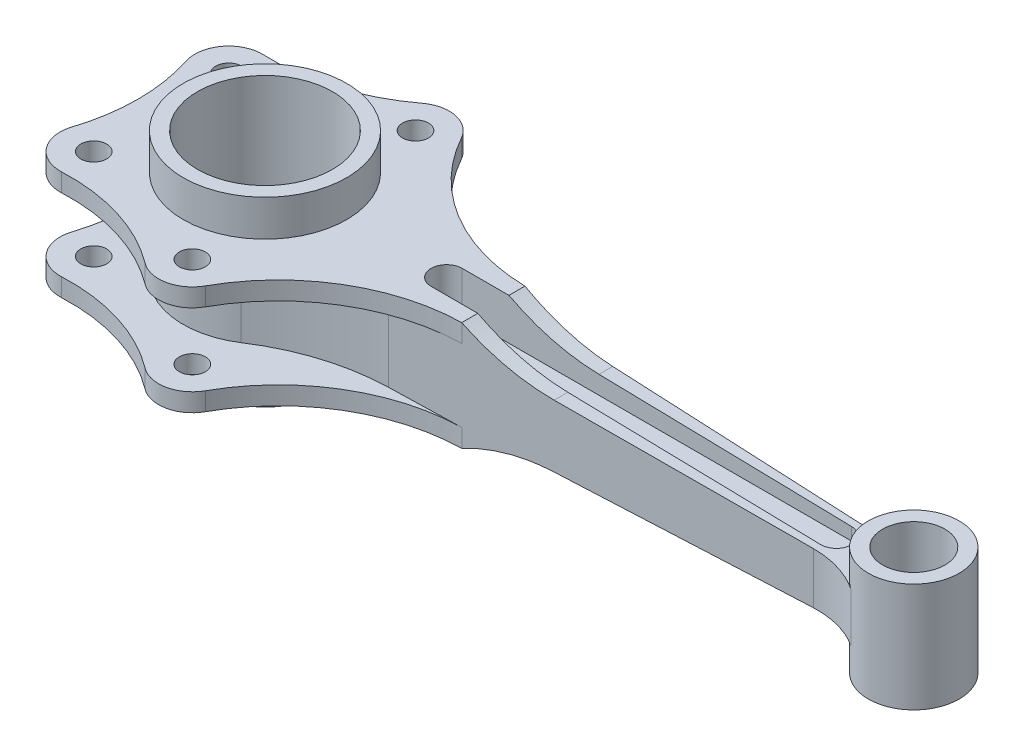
ISO-10303-21;
HEADER;
FILE_DESCRIPTION(('STEP AP214'),'2;1');
FILE_NAME('part.step','',(''),(''),'','','');
FILE_SCHEMA(('AUTOMOTIVE_DESIGN { 1 0 10303 214 1 1 1 1 }'));
ENDSEC;
DATA;
#1=APPLICATION_CONTEXT('core data for automotive mechanical design processes');
#2=APPLICATION_PROTOCOL_DEFINITION('international standard','automotive_design',2000,#1);
#3=PRODUCT_CONTEXT('',#1,'mechanical');
#4=PRODUCT('Part','Part','',(#3));
#5=PRODUCT_RELATED_PRODUCT_CATEGORY('part','',(#4));
#6=PRODUCT_DEFINITION_FORMATION('','',#4);
#7=PRODUCT_DEFINITION_CONTEXT('part definition',#1,'design');
#8=PRODUCT_DEFINITION('design','',#6,#7);
#9=PRODUCT_DEFINITION_SHAPE('','',#8);
#10=(LENGTH_UNIT() NAMED_UNIT(*) SI_UNIT(.MILLI.,.METRE.));
#11=(NAMED_UNIT(*) PLANE_ANGLE_UNIT() SI_UNIT($,.RADIAN.));
#12=(NAMED_UNIT(*) SI_UNIT($,.STERADIAN.) SOLID_ANGLE_UNIT());
#13=UNCERTAINTY_MEASURE_WITH_UNIT(LENGTH_MEASURE(1.E-05),#10,'distance_accuracy_value','');
#14=(GEOMETRIC_REPRESENTATION_CONTEXT(3) GLOBAL_UNCERTAINTY_ASSIGNED_CONTEXT((#13)) GLOBAL_UNIT_ASSIGNED_CONTEXT((#10,
#11,#12)) REPRESENTATION_CONTEXT('',''));
#15=CARTESIAN_POINT('',(0.,0.,0.));
#16=DIRECTION('',(0.,0.,1.));
#17=DIRECTION('',(1.,0.,0.));
#18=AXIS2_PLACEMENT_3D('',#15,#16,#17);
#19=CARTESIAN_POINT('',(-119.815252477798,-21.,0.));
#20=DIRECTION('',(0.,1.,0.));
#21=DIRECTION('',(0.,0.,1.));
#22=AXIS2_PLACEMENT_3D('',#19,#20,#21);
#23=PLANE('',#22);
#24=CARTESIAN_POINT('',(15.,-21.,43.));
#25=DIRECTION('',(0.,1.,0.));
#26=DIRECTION('',(0.,0.,1.));
#27=AXIS2_PLACEMENT_3D('',#24,#25,#26);
#28=CIRCLE('',#27,4.99999999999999);
#29=CARTESIAN_POINT('',(15.,-21.,48.));
#30=VERTEX_POINT('',#29);
#31=EDGE_CURVE('E429',#30,#30,#28,.T.);
#32=ORIENTED_EDGE('',*,*,#31,.T.);
#33=EDGE_LOOP('',(#32));
#34=FACE_BOUND('',#33,.T.);
#35=CARTESIAN_POINT('',(-40.,-21.,26.));
#36=DIRECTION('',(0.,1.,0.));
#37=DIRECTION('',(0.,0.,1.));
#38=AXIS2_PLACEMENT_3D('',#35,#36,#37);
#39=CIRCLE('',#38,4.99999999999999);
#40=CARTESIAN_POINT('',(-40.,-21.,31.));
#41=VERTEX_POINT('',#40);
#42=EDGE_CURVE('E426',#41,#41,#39,.T.);
#43=ORIENTED_EDGE('',*,*,#42,.T.);
#44=EDGE_LOOP('',(#43));
#45=FACE_BOUND('',#44,.T.);
#46=CARTESIAN_POINT('',(-40.,-21.,-26.));
#47=DIRECTION('',(0.,1.,0.));
#48=DIRECTION('',(0.,0.,1.));
#49=AXIS2_PLACEMENT_3D('',#46,#47,#48);
#50=CIRCLE('',#49,4.99999999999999);
#51=CARTESIAN_POINT('',(-40.,-21.,-21.));
#52=VERTEX_POINT('',#51);
#53=EDGE_CURVE('E444',#52,#52,#50,.T.);
#54=ORIENTED_EDGE('',*,*,#53,.T.);
#55=EDGE_LOOP('',(#54));
#56=FACE_BOUND('',#55,.T.);
#57=CARTESIAN_POINT('',(15.,-21.,-43.));
#58=DIRECTION('',(0.,1.,0.));
#59=DIRECTION('',(0.,0.,1.));
#60=AXIS2_PLACEMENT_3D('',#57,#58,#59);
#61=CIRCLE('',#60,4.99999999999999);
#62=CARTESIAN_POINT('',(15.,-21.,-38.));
#63=VERTEX_POINT('',#62);
#64=EDGE_CURVE('E451',#63,#63,#61,.T.);
#65=ORIENTED_EDGE('',*,*,#64,.T.);
#66=EDGE_LOOP('',(#65));
#67=FACE_BOUND('',#66,.T.);
#68=CARTESIAN_POINT('',(0.,-21.,0.));
#69=DIRECTION('',(0.,1.,0.));
#70=DIRECTION('',(0.,0.,1.));
#71=AXIS2_PLACEMENT_3D('',#68,#69,#70);
#72=CIRCLE('',#71,31.5);
#73=CARTESIAN_POINT('',(0.,-21.,31.5));
#74=VERTEX_POINT('',#73);
#75=EDGE_CURVE('E777',#74,#74,#72,.T.);
#76=ORIENTED_EDGE('',*,*,#75,.T.);
#77=EDGE_LOOP('',(#76));
#78=FACE_BOUND('',#77,.T.);
#79=DIRECTION('',(0.,0.,1.));
#80=VECTOR('',#79,1.);
#81=CARTESIAN_POINT('',(88.,-21.,-21.));
#82=LINE('',#81,#80);
#83=CARTESIAN_POINT('',(88.,-21.,5.99999999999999));
#84=VERTEX_POINT('',#83);
#85=CARTESIAN_POINT('',(88.,-21.,12.1764542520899));
#86=VERTEX_POINT('',#85);
#87=EDGE_CURVE('E462',#84,#86,#82,.T.);
#88=ORIENTED_EDGE('',*,*,#87,.T.);
#89=DIRECTION('',(0.,0.,-1.));
#90=VECTOR('',#89,1.);
#91=CARTESIAN_POINT('',(88.,-21.,-12.178319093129));
#92=LINE('',#91,#90);
#93=CARTESIAN_POINT('',(88.,-21.,12.178319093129));
#94=VERTEX_POINT('',#93);
#95=EDGE_CURVE('E549',#94,#86,#92,.T.);
#96=ORIENTED_EDGE('',*,*,#95,.F.);
#97=CARTESIAN_POINT('',(89.3667555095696,-21.,84.1653455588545));
#98=DIRECTION('',(0.,-1.,0.));
#99=DIRECTION('',(0.,0.,-1.));
#100=AXIS2_PLACEMENT_3D('',#97,#98,#99);
#101=CIRCLE('',#100,72.);
#102=CARTESIAN_POINT('',(26.3737390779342,-21.,49.2958763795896));
#103=VERTEX_POINT('',#102);
#104=EDGE_CURVE('E552',#103,#94,#101,.T.);
#105=ORIENTED_EDGE('',*,*,#104,.F.);
#106=CARTESIAN_POINT('',(15.,-21.,43.));
#107=DIRECTION('',(0.,1.,0.));
#108=DIRECTION('',(0.,0.,1.));
#109=AXIS2_PLACEMENT_3D('',#106,#107,#108);
#110=CIRCLE('',#109,13.);
#111=CARTESIAN_POINT('',(7.18194667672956,-21.,53.3864354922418));
#112=VERTEX_POINT('',#111);
#113=EDGE_CURVE('E554',#112,#103,#110,.T.);
#114=ORIENTED_EDGE('',*,*,#113,.F.);
#115=CARTESIAN_POINT('',(-36.1180409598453,-21.,110.911308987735));
#116=DIRECTION('',(0.,-1.,0.));
#117=DIRECTION('',(0.,0.,-1.));
#118=AXIS2_PLACEMENT_3D('',#115,#116,#117);
#119=CIRCLE('',#118,72.);
#120=CARTESIAN_POINT('',(-39.4062886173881,-21.,38.9864354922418));
#121=VERTEX_POINT('',#120);
#122=EDGE_CURVE('E557',#121,#112,#119,.T.);
#123=ORIENTED_EDGE('',*,*,#122,.F.);
#124=CARTESIAN_POINT('',(-40.,-21.,26.));
#125=DIRECTION('',(0.,1.,0.));
#126=DIRECTION('',(0.,0.,1.));
#127=AXIS2_PLACEMENT_3D('',#124,#125,#126);
#128=CIRCLE('',#127,13.);
#129=CARTESIAN_POINT('',(-52.3769011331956,-21.,22.0235294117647));
#130=VERTEX_POINT('',#129);
#131=EDGE_CURVE('E559',#130,#121,#128,.T.);
#132=ORIENTED_EDGE('',*,*,#131,.F.);
#133=CARTESIAN_POINT('',(-120.925892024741,-21.,0.));
#134=DIRECTION('',(0.,-1.,0.));
#135=DIRECTION('',(0.,0.,-1.));
#136=AXIS2_PLACEMENT_3D('',#133,#134,#135);
#137=CIRCLE('',#136,72.);
#138=CARTESIAN_POINT('',(-52.3769011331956,-21.,-22.0235294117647));
#139=VERTEX_POINT('',#138);
#140=EDGE_CURVE('E561',#139,#130,#137,.T.);
#141=ORIENTED_EDGE('',*,*,#140,.F.);
#142=CARTESIAN_POINT('',(-40.,-21.,-26.));
#143=DIRECTION('',(0.,1.,0.));
#144=DIRECTION('',(0.,0.,1.));
#145=AXIS2_PLACEMENT_3D('',#142,#143,#144);
#146=CIRCLE('',#145,13.);
#147=CARTESIAN_POINT('',(-39.4062886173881,-21.,-38.9864354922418));
#148=VERTEX_POINT('',#147);
#149=EDGE_CURVE('E563',#148,#139,#146,.T.);
#150=ORIENTED_EDGE('',*,*,#149,.F.);
#151=CARTESIAN_POINT('',(-36.1180409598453,-21.,-110.911308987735));
#152=DIRECTION('',(0.,-1.,0.));
#153=DIRECTION('',(0.,0.,1.));
#154=AXIS2_PLACEMENT_3D('',#151,#152,#153);
#155=CIRCLE('',#154,72.);
#156=CARTESIAN_POINT('',(7.18194667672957,-21.,-53.3864354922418));
#157=VERTEX_POINT('',#156);
#158=EDGE_CURVE('E565',#157,#148,#155,.T.);
#159=ORIENTED_EDGE('',*,*,#158,.F.);
#160=CARTESIAN_POINT('',(15.,-21.,-43.));
#161=DIRECTION('',(0.,1.,0.));
#162=DIRECTION('',(0.,0.,1.));
#163=AXIS2_PLACEMENT_3D('',#160,#161,#162);
#164=CIRCLE('',#163,13.);
#165=CARTESIAN_POINT('',(26.3737390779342,-21.,-49.2958763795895));
#166=VERTEX_POINT('',#165);
#167=EDGE_CURVE('E567',#166,#157,#164,.T.);
#168=ORIENTED_EDGE('',*,*,#167,.F.);
#169=CARTESIAN_POINT('',(89.3667555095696,-21.,-84.1653455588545));
#170=DIRECTION('',(0.,-1.,0.));
#171=DIRECTION('',(0.,0.,1.));
#172=AXIS2_PLACEMENT_3D('',#169,#170,#171);
#173=CIRCLE('',#172,72.);
#174=CARTESIAN_POINT('',(88.,-21.,-12.178319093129));
#175=VERTEX_POINT('',#174);
#176=EDGE_CURVE('E519',#175,#166,#173,.T.);
#177=ORIENTED_EDGE('',*,*,#176,.F.);
#178=CARTESIAN_POINT('',(88.,-21.,-12.1764542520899));
#179=VERTEX_POINT('',#178);
#180=EDGE_CURVE('E548',#179,#175,#92,.T.);
#181=ORIENTED_EDGE('',*,*,#180,.F.);
#182=CARTESIAN_POINT('',(88.,-21.,-6.));
#183=VERTEX_POINT('',#182);
#184=EDGE_CURVE('E471',#179,#183,#82,.T.);
#185=ORIENTED_EDGE('',*,*,#184,.T.);
#186=DIRECTION('',(-1.,0.,0.));
#187=VECTOR('',#186,1.);
#188=CARTESIAN_POINT('',(70.,-21.,-6.));
#189=LINE('',#188,#187);
#190=CARTESIAN_POINT('',(70.,-21.,-6.));
#191=VERTEX_POINT('',#190);
#192=EDGE_CURVE('E61',#183,#191,#189,.T.);
#193=ORIENTED_EDGE('',*,*,#192,.T.);
#194=CARTESIAN_POINT('',(70.,-21.,0.));
#195=DIRECTION('',(0.,1.,0.));
#196=DIRECTION('',(0.,0.,1.));
#197=AXIS2_PLACEMENT_3D('',#194,#195,#196);
#198=CIRCLE('',#197,6.);
#199=CARTESIAN_POINT('',(70.,-21.,6.));
#200=VERTEX_POINT('',#199);
#201=EDGE_CURVE('E489',#191,#200,#198,.T.);
#202=ORIENTED_EDGE('',*,*,#201,.T.);
#203=DIRECTION('',(1.,0.,0.));
#204=VECTOR('',#203,1.);
#205=CARTESIAN_POINT('',(70.,-21.,6.));
#206=LINE('',#205,#204);
#207=EDGE_CURVE('E494',#200,#84,#206,.T.);
#208=ORIENTED_EDGE('',*,*,#207,.T.);
#209=EDGE_LOOP('',(#88,#96,#105,#114,#123,#132,#141,#150,#159,#168,#177,#181,#185,#193,#202,#208));
#210=FACE_BOUND('',#209,.T.);
#211=ADVANCED_FACE('F36',(#34,#45,#56,#67,#78,#210),#23,.F.);
#212=CARTESIAN_POINT('',(-119.354217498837,21.,17.6062155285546));
#213=DIRECTION('',(-0.0261769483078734,0.,-0.999657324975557));
#214=DIRECTION('',(-0.999657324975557,0.,0.0261769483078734));
#215=AXIS2_PLACEMENT_3D('',#212,#213,#214);
#216=PLANE('',#215);
#217=CARTESIAN_POINT('',(124.408257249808,-89.9814381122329,11.2230704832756));
#218=DIRECTION('',(-0.0261769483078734,0.,-0.999657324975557));
#219=DIRECTION('',(-0.999657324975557,0.,0.0261769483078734));
#220=AXIS2_PLACEMENT_3D('',#217,#218,#219);
#221=ELLIPSE('',#220,78.0267378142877,78.);
#222=CARTESIAN_POINT('',(122.706696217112,-12.,11.267627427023));
#223=VERTEX_POINT('',#222);
#224=EDGE_CURVE('E487',#223,#86,#221,.F.);
#225=ORIENTED_EDGE('',*,*,#224,.F.);
#226=DIRECTION('',(-0.999419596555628,-0.0218074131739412,0.0261707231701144));
#227=VECTOR('',#226,1.);
#228=CARTESIAN_POINT('',(-118.519875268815,-17.2635825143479,17.5843675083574));
#229=LINE('',#228,#227);
#230=CARTESIAN_POINT('',(220.,-9.87705255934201,8.71991260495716));
#231=VERTEX_POINT('',#230);
#232=EDGE_CURVE('E479',#231,#223,#229,.T.);
#233=ORIENTED_EDGE('',*,*,#232,.F.);
#234=DIRECTION('',(0.,-1.,0.));
#235=VECTOR('',#234,1.);
#236=CARTESIAN_POINT('',(220.,21.,8.71991260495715));
#237=LINE('',#236,#235);
#238=CARTESIAN_POINT('',(220.,9.87705255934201,8.71991260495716));
#239=VERTEX_POINT('',#238);
#240=EDGE_CURVE('E371',#239,#231,#237,.T.);
#241=ORIENTED_EDGE('',*,*,#240,.F.);
#242=DIRECTION('',(-0.999419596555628,0.0218074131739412,0.0261707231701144));
#243=VECTOR('',#242,1.);
#244=CARTESIAN_POINT('',(-119.435255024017,17.2835561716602,17.6083375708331));
#245=LINE('',#244,#243);
#246=CARTESIAN_POINT('',(122.706696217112,12.,11.267627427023));
#247=VERTEX_POINT('',#246);
#248=EDGE_CURVE('E632',#239,#247,#245,.T.);
#249=ORIENTED_EDGE('',*,*,#248,.T.);
#250=CARTESIAN_POINT('',(124.408257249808,89.9814381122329,11.2230704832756));
#251=DIRECTION('',(-0.0261769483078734,0.,-0.999657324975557));
#252=DIRECTION('',(-0.999657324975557,0.,0.0261769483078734));
#253=AXIS2_PLACEMENT_3D('',#250,#251,#252);
#254=ELLIPSE('',#253,78.0267378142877,78.);
#255=CARTESIAN_POINT('',(88.,21.,12.1764542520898));
#256=VERTEX_POINT('',#255);
#257=EDGE_CURVE('E640',#247,#256,#254,.T.);
#258=ORIENTED_EDGE('',*,*,#257,.T.);
#259=DIRECTION('',(0.,-1.,0.));
#260=VECTOR('',#259,1.);
#261=CARTESIAN_POINT('',(88.,21.,12.1764542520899));
#262=LINE('',#261,#260);
#263=CARTESIAN_POINT('',(88.0000000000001,14.,12.1764542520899));
#264=VERTEX_POINT('',#263);
#265=EDGE_CURVE('E764',#256,#264,#262,.T.);
#266=ORIENTED_EDGE('',*,*,#265,.T.);
#267=DIRECTION('',(0.999657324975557,0.,-0.0261769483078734));
#268=VECTOR('',#267,1.);
#269=CARTESIAN_POINT('',(-119.354217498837,14.,17.6062155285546));
#270=LINE('',#269,#268);
#271=CARTESIAN_POINT('',(87.4820152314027,14.,12.1900181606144));
#272=VERTEX_POINT('',#271);
#273=EDGE_CURVE('E771',#272,#264,#270,.T.);
#274=ORIENTED_EDGE('',*,*,#273,.F.);
#275=CARTESIAN_POINT('',(60.430871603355,14.,12.8983772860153));
#276=VERTEX_POINT('',#275);
#277=EDGE_CURVE('E773',#276,#272,#270,.T.);
#278=ORIENTED_EDGE('',*,*,#277,.F.);
#279=DIRECTION('',(0.,-1.,0.));
#280=VECTOR('',#279,1.);
#281=CARTESIAN_POINT('',(60.430871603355,21.,12.8983772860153));
#282=LINE('',#281,#280);
#283=CARTESIAN_POINT('',(60.430871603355,-14.,12.8983772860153));
#284=VERTEX_POINT('',#283);
#285=EDGE_CURVE('E379',#276,#284,#282,.T.);
#286=ORIENTED_EDGE('',*,*,#285,.T.);
#287=DIRECTION('',(-0.999657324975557,0.,0.0261769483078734));
#288=VECTOR('',#287,1.);
#289=CARTESIAN_POINT('',(-119.354217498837,-14.,17.6062155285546));
#290=LINE('',#289,#288);
#291=CARTESIAN_POINT('',(87.4820152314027,-14.,12.1900181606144));
#292=VERTEX_POINT('',#291);
#293=EDGE_CURVE('E605',#292,#284,#290,.T.);
#294=ORIENTED_EDGE('',*,*,#293,.F.);
#295=CARTESIAN_POINT('',(88.,-14.,12.1764542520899));
#296=VERTEX_POINT('',#295);
#297=EDGE_CURVE('E607',#296,#292,#290,.T.);
#298=ORIENTED_EDGE('',*,*,#297,.F.);
#299=DIRECTION('',(0.,1.,0.));
#300=VECTOR('',#299,1.);
#301=CARTESIAN_POINT('',(88.,21.,12.1764542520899));
#302=LINE('',#301,#300);
#303=EDGE_CURVE('E601',#86,#296,#302,.T.);
#304=ORIENTED_EDGE('',*,*,#303,.F.);
#305=EDGE_LOOP('',(#225,#233,#241,#249,#258,#266,#274,#278,#286,#294,#298,#304));
#306=FACE_BOUND('',#305,.T.);
#307=ADVANCED_FACE('F854',(#306),#216,.F.);
#308=CARTESIAN_POINT('',(-119.354217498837,21.,-17.6062155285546));
#309=DIRECTION('',(0.0261769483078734,0.,-0.999657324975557));
#310=DIRECTION('',(-0.999657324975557,0.,-0.0261769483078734));
#311=AXIS2_PLACEMENT_3D('',#308,#309,#310);
#312=PLANE('',#311);
#313=DIRECTION('',(-0.999419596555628,-0.0218074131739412,-0.0261707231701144));
#314=VECTOR('',#313,1.);
#315=CARTESIAN_POINT('',(-118.519875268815,-17.2635825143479,-17.5843675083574));
#316=LINE('',#315,#314);
#317=CARTESIAN_POINT('',(220.,-9.87705255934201,-8.71991260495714));
#318=VERTEX_POINT('',#317);
#319=CARTESIAN_POINT('',(122.706696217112,-12.,-11.267627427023));
#320=VERTEX_POINT('',#319);
#321=EDGE_CURVE('E360',#318,#320,#316,.T.);
#322=ORIENTED_EDGE('',*,*,#321,.T.);
#323=CARTESIAN_POINT('',(124.408257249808,-89.9814381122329,-11.2230704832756));
#324=DIRECTION('',(0.0261769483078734,0.,-0.999657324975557));
#325=DIRECTION('',(0.999657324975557,0.,0.0261769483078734));
#326=AXIS2_PLACEMENT_3D('',#323,#324,#325);
#327=ELLIPSE('',#326,78.0267378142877,78.);
#328=EDGE_CURVE('E484',#320,#179,#327,.F.);
#329=ORIENTED_EDGE('',*,*,#328,.T.);
#330=DIRECTION('',(0.,1.,0.));
#331=VECTOR('',#330,1.);
#332=CARTESIAN_POINT('',(88.,21.,-12.1764542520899));
#333=LINE('',#332,#331);
#334=CARTESIAN_POINT('',(88.,-14.,-12.1764542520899));
#335=VERTEX_POINT('',#334);
#336=EDGE_CURVE('E572',#179,#335,#333,.T.);
#337=ORIENTED_EDGE('',*,*,#336,.T.);
#338=DIRECTION('',(-0.999657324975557,0.,-0.0261769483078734));
#339=VECTOR('',#338,1.);
#340=CARTESIAN_POINT('',(-119.354217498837,-14.,-17.6062155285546));
#341=LINE('',#340,#339);
#342=CARTESIAN_POINT('',(87.4820152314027,-14.,-12.1900181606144));
#343=VERTEX_POINT('',#342);
#344=EDGE_CURVE('E405',#335,#343,#341,.T.);
#345=ORIENTED_EDGE('',*,*,#344,.T.);
#346=CARTESIAN_POINT('',(60.430871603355,-14.,-12.8983772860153));
#347=VERTEX_POINT('',#346);
#348=EDGE_CURVE('E408',#343,#347,#341,.T.);
#349=ORIENTED_EDGE('',*,*,#348,.T.);
#350=DIRECTION('',(0.,-1.,0.));
#351=VECTOR('',#350,1.);
#352=CARTESIAN_POINT('',(60.430871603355,21.,-12.8983772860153));
#353=LINE('',#352,#351);
#354=CARTESIAN_POINT('',(60.430871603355,14.,-12.8983772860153));
#355=VERTEX_POINT('',#354);
#356=EDGE_CURVE('E373',#355,#347,#353,.T.);
#357=ORIENTED_EDGE('',*,*,#356,.F.);
#358=DIRECTION('',(0.999657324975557,0.,0.0261769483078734));
#359=VECTOR('',#358,1.);
#360=CARTESIAN_POINT('',(-119.354217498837,14.,-17.6062155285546));
#361=LINE('',#360,#359);
#362=CARTESIAN_POINT('',(87.4820152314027,14.,-12.1900181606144));
#363=VERTEX_POINT('',#362);
#364=EDGE_CURVE('E767',#355,#363,#361,.T.);
#365=ORIENTED_EDGE('',*,*,#364,.T.);
#366=CARTESIAN_POINT('',(88.0000000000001,14.,-12.1764542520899));
#367=VERTEX_POINT('',#366);
#368=EDGE_CURVE('E770',#363,#367,#361,.T.);
#369=ORIENTED_EDGE('',*,*,#368,.T.);
#370=DIRECTION('',(0.,-1.,0.));
#371=VECTOR('',#370,1.);
#372=CARTESIAN_POINT('',(88.,21.,-12.1764542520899));
#373=LINE('',#372,#371);
#374=CARTESIAN_POINT('',(88.,21.,-12.1764542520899));
#375=VERTEX_POINT('',#374);
#376=EDGE_CURVE('E742',#375,#367,#373,.T.);
#377=ORIENTED_EDGE('',*,*,#376,.F.);
#378=CARTESIAN_POINT('',(124.408257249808,89.9814381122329,-11.2230704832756));
#379=DIRECTION('',(0.0261769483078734,0.,-0.999657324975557));
#380=DIRECTION('',(0.999657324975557,0.,0.0261769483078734));
#381=AXIS2_PLACEMENT_3D('',#378,#379,#380);
#382=ELLIPSE('',#381,78.0267378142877,78.);
#383=CARTESIAN_POINT('',(122.706696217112,12.,-11.267627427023));
#384=VERTEX_POINT('',#383);
#385=EDGE_CURVE('E638',#384,#375,#382,.T.);
#386=ORIENTED_EDGE('',*,*,#385,.F.);
#387=DIRECTION('',(-0.999419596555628,0.0218074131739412,-0.0261707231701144));
#388=VECTOR('',#387,1.);
#389=CARTESIAN_POINT('',(-119.435255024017,17.2835561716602,-17.6083375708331));
#390=LINE('',#389,#388);
#391=CARTESIAN_POINT('',(220.,9.87705255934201,-8.71991260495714));
#392=VERTEX_POINT('',#391);
#393=EDGE_CURVE('E624',#392,#384,#390,.T.);
#394=ORIENTED_EDGE('',*,*,#393,.F.);
#395=DIRECTION('',(0.,-1.,0.));
#396=VECTOR('',#395,1.);
#397=CARTESIAN_POINT('',(220.,21.,-8.71991260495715));
#398=LINE('',#397,#396);
#399=EDGE_CURVE('E369',#392,#318,#398,.T.);
#400=ORIENTED_EDGE('',*,*,#399,.T.);
#401=EDGE_LOOP('',(#322,#329,#337,#345,#349,#357,#365,#369,#377,#386,#394,#400));
#402=FACE_BOUND('',#401,.T.);
#403=ADVANCED_FACE('F794',(#402),#312,.T.);
#404=CARTESIAN_POINT('',(220.916193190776,21.,43.7079189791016));
#405=DIRECTION('',(0.,-1.,0.));
#406=DIRECTION('',(0.,0.,-1.));
#407=AXIS2_PLACEMENT_3D('',#404,#405,#406);
#408=CYLINDRICAL_SURFACE('',#407,35.);
#409=CARTESIAN_POINT('',(220.916193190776,-9.8570611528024,43.7079189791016));
#410=DIRECTION('',(0.0218148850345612,-0.999762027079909,0.));
#411=DIRECTION('',(-0.999762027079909,-0.0218148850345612,0.));
#412=AXIS2_PLACEMENT_3D('',#409,#410,#411);
#413=ELLIPSE('',#412,35.0083310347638,35.);
#414=CARTESIAN_POINT('',(240.305397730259,-9.43398720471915,14.5693063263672));
#415=VERTEX_POINT('',#414);
#416=EDGE_CURVE('E353',#415,#231,#413,.F.);
#417=ORIENTED_EDGE('',*,*,#416,.F.);
#418=DIRECTION('',(0.,-1.,0.));
#419=VECTOR('',#418,1.);
#420=CARTESIAN_POINT('',(240.305397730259,21.,14.5693063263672));
#421=LINE('',#420,#419);
#422=CARTESIAN_POINT('',(240.305397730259,9.43398720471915,14.5693063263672));
#423=VERTEX_POINT('',#422);
#424=EDGE_CURVE('E351',#423,#415,#421,.T.);
#425=ORIENTED_EDGE('',*,*,#424,.F.);
#426=CARTESIAN_POINT('',(220.916193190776,9.8570611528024,43.7079189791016));
#427=DIRECTION('',(-0.0218148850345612,-0.999762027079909,0.));
#428=DIRECTION('',(0.999762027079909,-0.0218148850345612,0.));
#429=AXIS2_PLACEMENT_3D('',#426,#427,#428);
#430=ELLIPSE('',#429,35.0083310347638,35.);
#431=EDGE_CURVE('E629',#423,#239,#430,.F.);
#432=ORIENTED_EDGE('',*,*,#431,.T.);
#433=ORIENTED_EDGE('',*,*,#240,.T.);
#434=EDGE_LOOP('',(#417,#425,#432,#433));
#435=FACE_BOUND('',#434,.T.);
#436=ADVANCED_FACE('F976',(#435),#408,.F.);
#437=CARTESIAN_POINT('',(220.916193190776,21.,-43.7079189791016));
#438=DIRECTION('',(0.,-1.,0.));
#439=DIRECTION('',(0.,0.,-1.));
#440=AXIS2_PLACEMENT_3D('',#437,#438,#439);
#441=CYLINDRICAL_SURFACE('',#440,35.);
#442=DIRECTION('',(0.,-1.,0.));
#443=VECTOR('',#442,1.);
#444=CARTESIAN_POINT('',(240.305397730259,21.,-14.5693063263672));
#445=LINE('',#444,#443);
#446=CARTESIAN_POINT('',(240.305397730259,9.43398720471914,-14.5693063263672));
#447=VERTEX_POINT('',#446);
#448=CARTESIAN_POINT('',(240.305397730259,-9.43398720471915,-14.5693063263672));
#449=VERTEX_POINT('',#448);
#450=EDGE_CURVE('E348',#447,#449,#445,.T.);
#451=ORIENTED_EDGE('',*,*,#450,.T.);
#452=CARTESIAN_POINT('',(220.916193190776,-9.8570611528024,-43.7079189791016));
#453=DIRECTION('',(0.0218148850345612,-0.999762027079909,0.));
#454=DIRECTION('',(-0.999762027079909,-0.0218148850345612,0.));
#455=AXIS2_PLACEMENT_3D('',#452,#453,#454);
#456=ELLIPSE('',#455,35.0083310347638,35.);
#457=EDGE_CURVE('E354',#449,#318,#456,.T.);
#458=ORIENTED_EDGE('',*,*,#457,.T.);
#459=ORIENTED_EDGE('',*,*,#399,.F.);
#460=CARTESIAN_POINT('',(220.916193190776,9.8570611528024,-43.7079189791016));
#461=DIRECTION('',(-0.0218148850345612,-0.999762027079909,0.));
#462=DIRECTION('',(0.999762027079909,-0.0218148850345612,0.));
#463=AXIS2_PLACEMENT_3D('',#460,#461,#462);
#464=ELLIPSE('',#463,35.0083310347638,35.);
#465=EDGE_CURVE('E368',#447,#392,#464,.T.);
#466=ORIENTED_EDGE('',*,*,#465,.F.);
#467=EDGE_LOOP('',(#451,#458,#459,#466));
#468=FACE_BOUND('',#467,.T.);
#469=ADVANCED_FACE('F367',(#468),#441,.F.);
#470=CARTESIAN_POINT('',(70.,-5.,6.));
#471=DIRECTION('',(0.,0.,-1.));
#472=DIRECTION('',(-1.,0.,0.));
#473=AXIS2_PLACEMENT_3D('',#470,#471,#472);
#474=PLANE('',#473);
#475=DIRECTION('',(-0.999762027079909,-0.0218148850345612,0.));
#476=VECTOR('',#475,1.);
#477=CARTESIAN_POINT('',(70.1777504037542,-13.1461856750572,6.));
#478=LINE('',#477,#476);
#479=CARTESIAN_POINT('',(220.,-9.87705255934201,6.));
#480=VERTEX_POINT('',#479);
#481=CARTESIAN_POINT('',(122.706696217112,-12.,5.99999999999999));
#482=VERTEX_POINT('',#481);
#483=EDGE_CURVE('E364',#480,#482,#478,.T.);
#484=ORIENTED_EDGE('',*,*,#483,.T.);
#485=CARTESIAN_POINT('',(124.408257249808,-89.9814381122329,6.));
#486=DIRECTION('',(0.,0.,-1.));
#487=DIRECTION('',(-1.,0.,0.));
#488=AXIS2_PLACEMENT_3D('',#485,#486,#487);
#489=CIRCLE('',#488,78.);
#490=EDGE_CURVE('E481',#482,#84,#489,.F.);
#491=ORIENTED_EDGE('',*,*,#490,.T.);
#492=ORIENTED_EDGE('',*,*,#207,.F.);
#493=DIRECTION('',(0.,-1.,0.));
#494=VECTOR('',#493,1.);
#495=CARTESIAN_POINT('',(70.,-5.,6.));
#496=LINE('',#495,#494);
#497=CARTESIAN_POINT('',(70.,-5.,6.));
#498=VERTEX_POINT('',#497);
#499=EDGE_CURVE('E505',#498,#200,#496,.T.);
#500=ORIENTED_EDGE('',*,*,#499,.F.);
#501=DIRECTION('',(1.,0.,0.));
#502=VECTOR('',#501,1.);
#503=CARTESIAN_POINT('',(70.,-5.,6.));
#504=LINE('',#503,#502);
#505=CARTESIAN_POINT('',(220.,-5.,6.));
#506=VERTEX_POINT('',#505);
#507=EDGE_CURVE('E498',#498,#506,#504,.T.);
#508=ORIENTED_EDGE('',*,*,#507,.T.);
#509=DIRECTION('',(0.,-1.,0.));
#510=VECTOR('',#509,1.);
#511=CARTESIAN_POINT('',(220.,-5.,6.));
#512=LINE('',#511,#510);
#513=EDGE_CURVE('E509',#506,#480,#512,.T.);
#514=ORIENTED_EDGE('',*,*,#513,.T.);
#515=EDGE_LOOP('',(#484,#491,#492,#500,#508,#514));
#516=FACE_BOUND('',#515,.T.);
#517=ADVANCED_FACE('F979',(#516),#474,.T.);
#518=CARTESIAN_POINT('',(220.,-5.,0.));
#519=DIRECTION('',(0.,-1.,0.));
#520=DIRECTION('',(0.,0.,-1.));
#521=AXIS2_PLACEMENT_3D('',#518,#519,#520);
#522=CYLINDRICAL_SURFACE('',#521,6.);
#523=DIRECTION('',(0.,-1.,0.));
#524=VECTOR('',#523,1.);
#525=CARTESIAN_POINT('',(220.,-5.,-6.));
#526=LINE('',#525,#524);
#527=CARTESIAN_POINT('',(220.,-5.,-6.));
#528=VERTEX_POINT('',#527);
#529=CARTESIAN_POINT('',(220.,-9.87705255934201,-6.));
#530=VERTEX_POINT('',#529);
#531=EDGE_CURVE('E512',#528,#530,#526,.T.);
#532=ORIENTED_EDGE('',*,*,#531,.T.);
#533=CARTESIAN_POINT('',(220.,-9.87705255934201,0.));
#534=DIRECTION('',(0.0218148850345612,-0.999762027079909,0.));
#535=DIRECTION('',(-0.999762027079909,-0.0218148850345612,0.));
#536=AXIS2_PLACEMENT_3D('',#533,#534,#535);
#537=ELLIPSE('',#536,6.00142817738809,6.);
#538=EDGE_CURVE('E53',#530,#480,#537,.T.);
#539=ORIENTED_EDGE('',*,*,#538,.T.);
#540=ORIENTED_EDGE('',*,*,#513,.F.);
#541=CARTESIAN_POINT('',(220.,-5.,0.));
#542=DIRECTION('',(0.,1.,0.));
#543=DIRECTION('',(0.,0.,1.));
#544=AXIS2_PLACEMENT_3D('',#541,#542,#543);
#545=CIRCLE('',#544,6.);
#546=EDGE_CURVE('E496',#506,#528,#545,.T.);
#547=ORIENTED_EDGE('',*,*,#546,.T.);
#548=EDGE_LOOP('',(#532,#539,#540,#547));
#549=FACE_BOUND('',#548,.T.);
#550=ADVANCED_FACE('F1014',(#549),#522,.F.);
#551=CARTESIAN_POINT('',(70.,-5.,-6.));
#552=DIRECTION('',(0.,0.,1.));
#553=DIRECTION('',(1.,0.,0.));
#554=AXIS2_PLACEMENT_3D('',#551,#552,#553);
#555=PLANE('',#554);
#556=ORIENTED_EDGE('',*,*,#192,.F.);
#557=CARTESIAN_POINT('',(124.408257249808,-89.9814381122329,-6.));
#558=DIRECTION('',(0.,0.,1.));
#559=DIRECTION('',(1.,0.,0.));
#560=AXIS2_PLACEMENT_3D('',#557,#558,#559);
#561=CIRCLE('',#560,78.);
#562=CARTESIAN_POINT('',(122.706696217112,-12.,-6.));
#563=VERTEX_POINT('',#562);
#564=EDGE_CURVE('E11',#183,#563,#561,.F.);
#565=ORIENTED_EDGE('',*,*,#564,.T.);
#566=DIRECTION('',(0.999762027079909,0.0218148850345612,0.));
#567=VECTOR('',#566,1.);
#568=CARTESIAN_POINT('',(70.1777504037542,-13.1461856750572,-6.));
#569=LINE('',#568,#567);
#570=EDGE_CURVE('E45',#563,#530,#569,.T.);
#571=ORIENTED_EDGE('',*,*,#570,.T.);
#572=ORIENTED_EDGE('',*,*,#531,.F.);
#573=DIRECTION('',(-1.,0.,0.));
#574=VECTOR('',#573,1.);
#575=CARTESIAN_POINT('',(70.,-5.,-6.));
#576=LINE('',#575,#574);
#577=CARTESIAN_POINT('',(70.,-5.,-6.));
#578=VERTEX_POINT('',#577);
#579=EDGE_CURVE('E493',#528,#578,#576,.T.);
#580=ORIENTED_EDGE('',*,*,#579,.T.);
#581=DIRECTION('',(0.,-1.,0.));
#582=VECTOR('',#581,1.);
#583=CARTESIAN_POINT('',(70.,-5.,-6.));
#584=LINE('',#583,#582);
#585=EDGE_CURVE('E500',#578,#191,#584,.T.);
#586=ORIENTED_EDGE('',*,*,#585,.T.);
#587=EDGE_LOOP('',(#556,#565,#571,#572,#580,#586));
#588=FACE_BOUND('',#587,.T.);
#589=ADVANCED_FACE('F1010',(#588),#555,.T.);
#590=CARTESIAN_POINT('',(0.,35.,0.));
#591=DIRECTION('',(0.,-1.,0.));
#592=DIRECTION('',(0.,0.,-1.));
#593=AXIS2_PLACEMENT_3D('',#590,#591,#592);
#594=CYLINDRICAL_SURFACE('',#593,31.5);
#595=CARTESIAN_POINT('',(0.,-14.,0.));
#596=DIRECTION('',(0.,1.,0.));
#597=DIRECTION('',(0.,0.,1.));
#598=AXIS2_PLACEMENT_3D('',#595,#596,#597);
#599=CIRCLE('',#598,31.5);
#600=CARTESIAN_POINT('',(17.2228129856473,-14.,-26.3746983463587));
#601=VERTEX_POINT('',#600);
#602=CARTESIAN_POINT('',(17.2228129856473,-14.,26.3746983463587));
#603=VERTEX_POINT('',#602);
#604=EDGE_CURVE('E508',#601,#603,#599,.T.);
#605=ORIENTED_EDGE('',*,*,#604,.T.);
#606=DIRECTION('',(0.,-1.,0.));
#607=VECTOR('',#606,1.);
#608=CARTESIAN_POINT('',(17.2228129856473,21.,26.3746983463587));
#609=LINE('',#608,#607);
#610=CARTESIAN_POINT('',(17.2228129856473,14.,26.3746983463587));
#611=VERTEX_POINT('',#610);
#612=EDGE_CURVE('E382',#611,#603,#609,.T.);
#613=ORIENTED_EDGE('',*,*,#612,.F.);
#614=CARTESIAN_POINT('',(0.,14.,0.));
#615=DIRECTION('',(0.,1.,0.));
#616=DIRECTION('',(0.,0.,1.));
#617=AXIS2_PLACEMENT_3D('',#614,#615,#616);
#618=CIRCLE('',#617,31.5);
#619=CARTESIAN_POINT('',(17.2228129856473,14.,-26.3746983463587));
#620=VERTEX_POINT('',#619);
#621=EDGE_CURVE('E666',#620,#611,#618,.T.);
#622=ORIENTED_EDGE('',*,*,#621,.F.);
#623=DIRECTION('',(0.,-1.,0.));
#624=VECTOR('',#623,1.);
#625=CARTESIAN_POINT('',(17.2228129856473,21.,-26.3746983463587));
#626=LINE('',#625,#624);
#627=EDGE_CURVE('E781',#620,#601,#626,.T.);
#628=ORIENTED_EDGE('',*,*,#627,.T.);
#629=EDGE_LOOP('',(#605,#613,#622,#628));
#630=FACE_BOUND('',#629,.T.);
#631=ADVANCED_FACE('F863',(#630),#594,.T.);
#632=CARTESIAN_POINT('',(62.6035583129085,21.,95.8699352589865));
#633=DIRECTION('',(0.,-1.,0.));
#634=DIRECTION('',(0.,0.,-1.));
#635=AXIS2_PLACEMENT_3D('',#632,#633,#634);
#636=CYLINDRICAL_SURFACE('',#635,83.);
#637=ORIENTED_EDGE('',*,*,#612,.T.);
#638=CARTESIAN_POINT('',(62.6035583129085,-14.,95.8699352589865));
#639=DIRECTION('',(0.,-1.,0.));
#640=DIRECTION('',(0.,0.,-1.));
#641=AXIS2_PLACEMENT_3D('',#638,#639,#640);
#642=CIRCLE('',#641,83.);
#643=EDGE_CURVE('E608',#603,#284,#642,.T.);
#644=ORIENTED_EDGE('',*,*,#643,.T.);
#645=ORIENTED_EDGE('',*,*,#285,.F.);
#646=CARTESIAN_POINT('',(62.6035583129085,14.,95.8699352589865));
#647=DIRECTION('',(0.,1.,0.));
#648=DIRECTION('',(0.,0.,1.));
#649=AXIS2_PLACEMENT_3D('',#646,#647,#648);
#650=CIRCLE('',#649,83.);
#651=EDGE_CURVE('E774',#276,#611,#650,.T.);
#652=ORIENTED_EDGE('',*,*,#651,.T.);
#653=EDGE_LOOP('',(#637,#644,#645,#652));
#654=FACE_BOUND('',#653,.T.);
#655=ADVANCED_FACE('F860',(#654),#636,.F.);
#656=CARTESIAN_POINT('',(62.6035583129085,21.,-95.8699352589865));
#657=DIRECTION('',(0.,-1.,0.));
#658=DIRECTION('',(0.,0.,-1.));
#659=AXIS2_PLACEMENT_3D('',#656,#657,#658);
#660=CYLINDRICAL_SURFACE('',#659,83.);
#661=CARTESIAN_POINT('',(62.6035583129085,-14.,-95.8699352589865));
#662=DIRECTION('',(0.,-1.,0.));
#663=DIRECTION('',(0.,0.,-1.));
#664=AXIS2_PLACEMENT_3D('',#661,#662,#663);
#665=CIRCLE('',#664,83.);
#666=EDGE_CURVE('E603',#601,#347,#665,.F.);
#667=ORIENTED_EDGE('',*,*,#666,.F.);
#668=ORIENTED_EDGE('',*,*,#627,.F.);
#669=CARTESIAN_POINT('',(62.6035583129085,14.,-95.8699352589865));
#670=DIRECTION('',(0.,1.,0.));
#671=DIRECTION('',(0.,0.,1.));
#672=AXIS2_PLACEMENT_3D('',#669,#670,#671);
#673=CIRCLE('',#672,83.);
#674=EDGE_CURVE('E393',#355,#620,#673,.F.);
#675=ORIENTED_EDGE('',*,*,#674,.F.);
#676=ORIENTED_EDGE('',*,*,#356,.T.);
#677=EDGE_LOOP('',(#667,#668,#675,#676));
#678=FACE_BOUND('',#677,.T.);
#679=ADVANCED_FACE('F790',(#678),#660,.F.);
#680=CARTESIAN_POINT('',(0.,-35.,0.));
#681=DIRECTION('',(0.,1.,0.));
#682=DIRECTION('',(0.,0.,1.));
#683=AXIS2_PLACEMENT_3D('',#680,#681,#682);
#684=CIRCLE('',#683,31.5);
#685=CARTESIAN_POINT('',(0.,-35.,31.5));
#686=VERTEX_POINT('',#685);
#687=EDGE_CURVE('E385',#686,#686,#684,.T.);
#688=ORIENTED_EDGE('',*,*,#687,.T.);
#689=EDGE_LOOP('',(#688));
#690=FACE_BOUND('',#689,.T.);
#691=ORIENTED_EDGE('',*,*,#75,.F.);
#692=EDGE_LOOP('',(#691));
#693=FACE_BOUND('',#692,.T.);
#694=ADVANCED_FACE('F973',(#690,#693),#594,.T.);
#695=CARTESIAN_POINT('',(0.,21.,0.));
#696=DIRECTION('',(0.,1.,0.));
#697=DIRECTION('',(0.,0.,1.));
#698=AXIS2_PLACEMENT_3D('',#695,#696,#697);
#699=CIRCLE('',#698,31.5);
#700=CARTESIAN_POINT('',(0.,21.,31.5));
#701=VERTEX_POINT('',#700);
#702=EDGE_CURVE('E778',#701,#701,#699,.T.);
#703=ORIENTED_EDGE('',*,*,#702,.T.);
#704=EDGE_LOOP('',(#703));
#705=FACE_BOUND('',#704,.T.);
#706=CARTESIAN_POINT('',(0.,35.,0.));
#707=DIRECTION('',(0.,1.,0.));
#708=DIRECTION('',(0.,0.,1.));
#709=AXIS2_PLACEMENT_3D('',#706,#707,#708);
#710=CIRCLE('',#709,31.5);
#711=CARTESIAN_POINT('',(0.,35.,31.5));
#712=VERTEX_POINT('',#711);
#713=EDGE_CURVE('E386',#712,#712,#710,.T.);
#714=ORIENTED_EDGE('',*,*,#713,.F.);
#715=EDGE_LOOP('',(#714));
#716=FACE_BOUND('',#715,.T.);
#717=ADVANCED_FACE('F38',(#705,#716),#594,.T.);
#718=CARTESIAN_POINT('',(0.,35.,0.));
#719=DIRECTION('',(0.,-1.,0.));
#720=DIRECTION('',(0.,0.,-1.));
#721=AXIS2_PLACEMENT_3D('',#718,#719,#720);
#722=CYLINDRICAL_SURFACE('',#721,26.);
#723=CARTESIAN_POINT('',(0.,35.,0.));
#724=DIRECTION('',(0.,1.,0.));
#725=DIRECTION('',(0.,0.,1.));
#726=AXIS2_PLACEMENT_3D('',#723,#724,#725);
#727=CIRCLE('',#726,26.);
#728=CARTESIAN_POINT('',(0.,35.,26.));
#729=VERTEX_POINT('',#728);
#730=EDGE_CURVE('E389',#729,#729,#727,.T.);
#731=ORIENTED_EDGE('',*,*,#730,.T.);
#732=EDGE_LOOP('',(#731));
#733=FACE_BOUND('',#732,.T.);
#734=CARTESIAN_POINT('',(0.,-35.,0.));
#735=DIRECTION('',(0.,1.,0.));
#736=DIRECTION('',(0.,0.,1.));
#737=AXIS2_PLACEMENT_3D('',#734,#735,#736);
#738=CIRCLE('',#737,26.);
#739=CARTESIAN_POINT('',(0.,-35.,26.));
#740=VERTEX_POINT('',#739);
#741=EDGE_CURVE('E390',#740,#740,#738,.T.);
#742=ORIENTED_EDGE('',*,*,#741,.F.);
#743=EDGE_LOOP('',(#742));
#744=FACE_BOUND('',#743,.T.);
#745=ADVANCED_FACE('F989',(#733,#744),#722,.F.);
#746=CARTESIAN_POINT('',(-119.815252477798,35.,0.));
#747=DIRECTION('',(0.,1.,0.));
#748=DIRECTION('',(0.,0.,1.));
#749=AXIS2_PLACEMENT_3D('',#746,#747,#748);
#750=PLANE('',#749);
#751=ORIENTED_EDGE('',*,*,#713,.T.);
#752=EDGE_LOOP('',(#751));
#753=FACE_BOUND('',#752,.T.);
#754=ORIENTED_EDGE('',*,*,#730,.F.);
#755=EDGE_LOOP('',(#754));
#756=FACE_BOUND('',#755,.T.);
#757=ADVANCED_FACE('F985',(#753,#756),#750,.T.);
#758=CARTESIAN_POINT('',(-119.815252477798,-35.,0.));
#759=DIRECTION('',(0.,1.,0.));
#760=DIRECTION('',(0.,0.,1.));
#761=AXIS2_PLACEMENT_3D('',#758,#759,#760);
#762=PLANE('',#761);
#763=ORIENTED_EDGE('',*,*,#687,.F.);
#764=EDGE_LOOP('',(#763));
#765=FACE_BOUND('',#764,.T.);
#766=ORIENTED_EDGE('',*,*,#741,.T.);
#767=EDGE_LOOP('',(#766));
#768=FACE_BOUND('',#767,.T.);
#769=ADVANCED_FACE('F988',(#765,#768),#762,.F.);
#770=CARTESIAN_POINT('',(-119.815252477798,21.,0.));
#771=DIRECTION('',(0.,1.,0.));
#772=DIRECTION('',(0.,0.,1.));
#773=AXIS2_PLACEMENT_3D('',#770,#771,#772);
#774=PLANE('',#773);
#775=CARTESIAN_POINT('',(15.,21.,43.));
#776=DIRECTION('',(0.,1.,0.));
#777=DIRECTION('',(0.,0.,1.));
#778=AXIS2_PLACEMENT_3D('',#775,#776,#777);
#779=CIRCLE('',#778,4.99999999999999);
#780=CARTESIAN_POINT('',(15.,21.,48.));
#781=VERTEX_POINT('',#780);
#782=EDGE_CURVE('E1515',#781,#781,#779,.T.);
#783=ORIENTED_EDGE('',*,*,#782,.F.);
#784=EDGE_LOOP('',(#783));
#785=FACE_BOUND('',#784,.T.);
#786=CARTESIAN_POINT('',(-40.,21.,26.));
#787=DIRECTION('',(0.,1.,0.));
#788=DIRECTION('',(0.,0.,1.));
#789=AXIS2_PLACEMENT_3D('',#786,#787,#788);
#790=CIRCLE('',#789,5.);
#791=CARTESIAN_POINT('',(-40.,21.,31.));
#792=VERTEX_POINT('',#791);
#793=EDGE_CURVE('E422',#792,#792,#790,.T.);
#794=ORIENTED_EDGE('',*,*,#793,.F.);
#795=EDGE_LOOP('',(#794));
#796=FACE_BOUND('',#795,.T.);
#797=CARTESIAN_POINT('',(-40.,21.,-26.));
#798=DIRECTION('',(0.,1.,0.));
#799=DIRECTION('',(0.,0.,1.));
#800=AXIS2_PLACEMENT_3D('',#797,#798,#799);
#801=CIRCLE('',#800,5.);
#802=CARTESIAN_POINT('',(-40.,21.,-21.));
#803=VERTEX_POINT('',#802);
#804=EDGE_CURVE('E418',#803,#803,#801,.T.);
#805=ORIENTED_EDGE('',*,*,#804,.F.);
#806=EDGE_LOOP('',(#805));
#807=FACE_BOUND('',#806,.T.);
#808=CARTESIAN_POINT('',(15.,21.,-43.));
#809=DIRECTION('',(0.,1.,0.));
#810=DIRECTION('',(0.,0.,1.));
#811=AXIS2_PLACEMENT_3D('',#808,#809,#810);
#812=CIRCLE('',#811,4.99999999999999);
#813=CARTESIAN_POINT('',(15.,21.,-38.));
#814=VERTEX_POINT('',#813);
#815=EDGE_CURVE('E414',#814,#814,#812,.T.);
#816=ORIENTED_EDGE('',*,*,#815,.F.);
#817=EDGE_LOOP('',(#816));
#818=FACE_BOUND('',#817,.T.);
#819=DIRECTION('',(0.,0.,1.));
#820=VECTOR('',#819,1.);
#821=CARTESIAN_POINT('',(88.,21.,-21.));
#822=LINE('',#821,#820);
#823=CARTESIAN_POINT('',(88.,21.,-6.));
#824=VERTEX_POINT('',#823);
#825=EDGE_CURVE('E614',#375,#824,#822,.T.);
#826=ORIENTED_EDGE('',*,*,#825,.F.);
#827=DIRECTION('',(0.,0.,-1.));
#828=VECTOR('',#827,1.);
#829=CARTESIAN_POINT('',(88.,21.,-12.178319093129));
#830=LINE('',#829,#828);
#831=CARTESIAN_POINT('',(88.,21.,-12.178319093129));
#832=VERTEX_POINT('',#831);
#833=EDGE_CURVE('E735',#375,#832,#830,.T.);
#834=ORIENTED_EDGE('',*,*,#833,.T.);
#835=CARTESIAN_POINT('',(89.3667555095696,21.,-84.1653455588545));
#836=DIRECTION('',(0.,-1.,0.));
#837=DIRECTION('',(0.,0.,1.));
#838=AXIS2_PLACEMENT_3D('',#835,#836,#837);
#839=CIRCLE('',#838,72.);
#840=CARTESIAN_POINT('',(26.3737390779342,21.,-49.2958763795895));
#841=VERTEX_POINT('',#840);
#842=EDGE_CURVE('E676',#832,#841,#839,.T.);
#843=ORIENTED_EDGE('',*,*,#842,.T.);
#844=CARTESIAN_POINT('',(15.,21.,-43.));
#845=DIRECTION('',(0.,1.,0.));
#846=DIRECTION('',(0.,0.,1.));
#847=AXIS2_PLACEMENT_3D('',#844,#845,#846);
#848=CIRCLE('',#847,13.);
#849=CARTESIAN_POINT('',(7.18194667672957,21.,-53.3864354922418));
#850=VERTEX_POINT('',#849);
#851=EDGE_CURVE('E712',#841,#850,#848,.T.);
#852=ORIENTED_EDGE('',*,*,#851,.T.);
#853=CARTESIAN_POINT('',(-36.1180409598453,21.,-110.911308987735));
#854=DIRECTION('',(0.,-1.,0.));
#855=DIRECTION('',(0.,0.,1.));
#856=AXIS2_PLACEMENT_3D('',#853,#854,#855);
#857=CIRCLE('',#856,72.);
#858=CARTESIAN_POINT('',(-39.4062886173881,21.,-38.9864354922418));
#859=VERTEX_POINT('',#858);
#860=EDGE_CURVE('E715',#850,#859,#857,.T.);
#861=ORIENTED_EDGE('',*,*,#860,.T.);
#862=CARTESIAN_POINT('',(-40.,21.,-26.));
#863=DIRECTION('',(0.,1.,0.));
#864=DIRECTION('',(0.,0.,1.));
#865=AXIS2_PLACEMENT_3D('',#862,#863,#864);
#866=CIRCLE('',#865,13.);
#867=CARTESIAN_POINT('',(-52.3769011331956,21.,-22.0235294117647));
#868=VERTEX_POINT('',#867);
#869=EDGE_CURVE('E718',#859,#868,#866,.T.);
#870=ORIENTED_EDGE('',*,*,#869,.T.);
#871=CARTESIAN_POINT('',(-120.925892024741,21.,0.));
#872=DIRECTION('',(0.,-1.,0.));
#873=DIRECTION('',(0.,0.,-1.));
#874=AXIS2_PLACEMENT_3D('',#871,#872,#873);
#875=CIRCLE('',#874,72.);
#876=CARTESIAN_POINT('',(-52.3769011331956,21.,22.0235294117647));
#877=VERTEX_POINT('',#876);
#878=EDGE_CURVE('E721',#868,#877,#875,.T.);
#879=ORIENTED_EDGE('',*,*,#878,.T.);
#880=CARTESIAN_POINT('',(-40.,21.,26.));
#881=DIRECTION('',(0.,1.,0.));
#882=DIRECTION('',(0.,0.,1.));
#883=AXIS2_PLACEMENT_3D('',#880,#881,#882);
#884=CIRCLE('',#883,13.);
#885=CARTESIAN_POINT('',(-39.4062886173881,21.,38.9864354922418));
#886=VERTEX_POINT('',#885);
#887=EDGE_CURVE('E724',#877,#886,#884,.T.);
#888=ORIENTED_EDGE('',*,*,#887,.T.);
#889=CARTESIAN_POINT('',(-36.1180409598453,21.,110.911308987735));
#890=DIRECTION('',(0.,-1.,0.));
#891=DIRECTION('',(0.,0.,-1.));
#892=AXIS2_PLACEMENT_3D('',#889,#890,#891);
#893=CIRCLE('',#892,72.);
#894=CARTESIAN_POINT('',(7.18194667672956,21.,53.3864354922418));
#895=VERTEX_POINT('',#894);
#896=EDGE_CURVE('E727',#886,#895,#893,.T.);
#897=ORIENTED_EDGE('',*,*,#896,.T.);
#898=CARTESIAN_POINT('',(15.,21.,43.));
#899=DIRECTION('',(0.,1.,0.));
#900=DIRECTION('',(0.,0.,1.));
#901=AXIS2_PLACEMENT_3D('',#898,#899,#900);
#902=CIRCLE('',#901,13.);
#903=CARTESIAN_POINT('',(26.3737390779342,21.,49.2958763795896));
#904=VERTEX_POINT('',#903);
#905=EDGE_CURVE('E730',#895,#904,#902,.T.);
#906=ORIENTED_EDGE('',*,*,#905,.T.);
#907=CARTESIAN_POINT('',(89.3667555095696,21.,84.1653455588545));
#908=DIRECTION('',(0.,-1.,0.));
#909=DIRECTION('',(0.,0.,-1.));
#910=AXIS2_PLACEMENT_3D('',#907,#908,#909);
#911=CIRCLE('',#910,72.);
#912=CARTESIAN_POINT('',(88.,21.,12.178319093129));
#913=VERTEX_POINT('',#912);
#914=EDGE_CURVE('E733',#904,#913,#911,.T.);
#915=ORIENTED_EDGE('',*,*,#914,.T.);
#916=EDGE_CURVE('E736',#913,#256,#830,.T.);
#917=ORIENTED_EDGE('',*,*,#916,.T.);
#918=CARTESIAN_POINT('',(88.,21.,5.99999999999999));
#919=VERTEX_POINT('',#918);
#920=EDGE_CURVE('E612',#919,#256,#822,.T.);
#921=ORIENTED_EDGE('',*,*,#920,.F.);
#922=DIRECTION('',(1.,0.,0.));
#923=VECTOR('',#922,1.);
#924=CARTESIAN_POINT('',(70.,21.,6.));
#925=LINE('',#924,#923);
#926=CARTESIAN_POINT('',(70.,21.,6.));
#927=VERTEX_POINT('',#926);
#928=EDGE_CURVE('E659',#927,#919,#925,.T.);
#929=ORIENTED_EDGE('',*,*,#928,.F.);
#930=CARTESIAN_POINT('',(70.,21.,0.));
#931=DIRECTION('',(0.,1.,0.));
#932=DIRECTION('',(0.,0.,1.));
#933=AXIS2_PLACEMENT_3D('',#930,#931,#932);
#934=CIRCLE('',#933,6.);
#935=CARTESIAN_POINT('',(70.,21.,-6.));
#936=VERTEX_POINT('',#935);
#937=EDGE_CURVE('E643',#936,#927,#934,.T.);
#938=ORIENTED_EDGE('',*,*,#937,.F.);
#939=DIRECTION('',(-1.,0.,0.));
#940=VECTOR('',#939,1.);
#941=CARTESIAN_POINT('',(70.,21.,-6.));
#942=LINE('',#941,#940);
#943=EDGE_CURVE('E648',#824,#936,#942,.T.);
#944=ORIENTED_EDGE('',*,*,#943,.F.);
#945=EDGE_LOOP('',(#826,#834,#843,#852,#861,#870,#879,#888,#897,#906,#915,#917,#921,#929,#938,#944));
#946=FACE_BOUND('',#945,.T.);
#947=ORIENTED_EDGE('',*,*,#702,.F.);
#948=EDGE_LOOP('',(#947));
#949=FACE_BOUND('',#948,.T.);
#950=ADVANCED_FACE('F887',(#785,#796,#807,#818,#946,#949),#774,.T.);
#951=CARTESIAN_POINT('',(89.3667555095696,14.,-84.1653455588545));
#952=DIRECTION('',(0.,1.,0.));
#953=DIRECTION('',(0.,0.,1.));
#954=AXIS2_PLACEMENT_3D('',#951,#952,#953);
#955=PLANE('',#954);
#956=CARTESIAN_POINT('',(89.3667555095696,14.,84.1653455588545));
#957=DIRECTION('',(0.,-1.,0.));
#958=DIRECTION('',(0.,0.,-1.));
#959=AXIS2_PLACEMENT_3D('',#956,#957,#958);
#960=CIRCLE('',#959,72.);
#961=CARTESIAN_POINT('',(88.,14.,12.178319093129));
#962=VERTEX_POINT('',#961);
#963=EDGE_CURVE('E702',#272,#962,#960,.T.);
#964=ORIENTED_EDGE('',*,*,#963,.F.);
#965=ORIENTED_EDGE('',*,*,#273,.T.);
#966=DIRECTION('',(0.,0.,-1.));
#967=VECTOR('',#966,1.);
#968=CARTESIAN_POINT('',(88.,14.,-12.178319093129));
#969=LINE('',#968,#967);
#970=EDGE_CURVE('E707',#962,#264,#969,.T.);
#971=ORIENTED_EDGE('',*,*,#970,.F.);
#972=EDGE_LOOP('',(#964,#965,#971));
#973=FACE_BOUND('',#972,.T.);
#974=ADVANCED_FACE('F924',(#973),#955,.F.);
#975=CARTESIAN_POINT('',(15.,14.,43.));
#976=DIRECTION('',(0.,1.,0.));
#977=DIRECTION('',(0.,0.,1.));
#978=AXIS2_PLACEMENT_3D('',#975,#976,#977);
#979=CIRCLE('',#978,4.99999999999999);
#980=CARTESIAN_POINT('',(15.,14.,48.));
#981=VERTEX_POINT('',#980);
#982=EDGE_CURVE('E40',#981,#981,#979,.T.);
#983=ORIENTED_EDGE('',*,*,#982,.T.);
#984=EDGE_LOOP('',(#983));
#985=FACE_BOUND('',#984,.T.);
#986=CARTESIAN_POINT('',(-40.,14.,26.));
#987=DIRECTION('',(0.,1.,0.));
#988=DIRECTION('',(0.,0.,1.));
#989=AXIS2_PLACEMENT_3D('',#986,#987,#988);
#990=CIRCLE('',#989,4.99999999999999);
#991=CARTESIAN_POINT('',(-40.,14.,31.));
#992=VERTEX_POINT('',#991);
#993=EDGE_CURVE('E421',#992,#992,#990,.T.);
#994=ORIENTED_EDGE('',*,*,#993,.T.);
#995=EDGE_LOOP('',(#994));
#996=FACE_BOUND('',#995,.T.);
#997=CARTESIAN_POINT('',(-40.,14.,-26.));
#998=DIRECTION('',(0.,1.,0.));
#999=DIRECTION('',(0.,0.,1.));
#1000=AXIS2_PLACEMENT_3D('',#997,#998,#999);
#1001=CIRCLE('',#1000,4.99999999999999);
#1002=CARTESIAN_POINT('',(-40.,14.,-21.));
#1003=VERTEX_POINT('',#1002);
#1004=EDGE_CURVE('E417',#1003,#1003,#1001,.T.);
#1005=ORIENTED_EDGE('',*,*,#1004,.T.);
#1006=EDGE_LOOP('',(#1005));
#1007=FACE_BOUND('',#1006,.T.);
#1008=CARTESIAN_POINT('',(15.,14.,-43.));
#1009=DIRECTION('',(0.,1.,0.));
#1010=DIRECTION('',(0.,0.,1.));
#1011=AXIS2_PLACEMENT_3D('',#1008,#1009,#1010);
#1012=CIRCLE('',#1011,4.99999999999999);
#1013=CARTESIAN_POINT('',(15.,14.,-38.));
#1014=VERTEX_POINT('',#1013);
#1015=EDGE_CURVE('E413',#1014,#1014,#1012,.T.);
#1016=ORIENTED_EDGE('',*,*,#1015,.T.);
#1017=EDGE_LOOP('',(#1016));
#1018=FACE_BOUND('',#1017,.T.);
#1019=ORIENTED_EDGE('',*,*,#651,.F.);
#1020=ORIENTED_EDGE('',*,*,#277,.T.);
#1021=CARTESIAN_POINT('',(26.3737390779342,14.,49.2958763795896));
#1022=VERTEX_POINT('',#1021);
#1023=EDGE_CURVE('E703',#1022,#272,#960,.T.);
#1024=ORIENTED_EDGE('',*,*,#1023,.F.);
#1025=CARTESIAN_POINT('',(15.,14.,43.));
#1026=DIRECTION('',(0.,1.,0.));
#1027=DIRECTION('',(0.,0.,1.));
#1028=AXIS2_PLACEMENT_3D('',#1025,#1026,#1027);
#1029=CIRCLE('',#1028,13.);
#1030=CARTESIAN_POINT('',(7.18194667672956,14.,53.3864354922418));
#1031=VERTEX_POINT('',#1030);
#1032=EDGE_CURVE('E699',#1031,#1022,#1029,.T.);
#1033=ORIENTED_EDGE('',*,*,#1032,.F.);
#1034=CARTESIAN_POINT('',(-36.1180409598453,14.,110.911308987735));
#1035=DIRECTION('',(0.,-1.,0.));
#1036=DIRECTION('',(0.,0.,-1.));
#1037=AXIS2_PLACEMENT_3D('',#1034,#1035,#1036);
#1038=CIRCLE('',#1037,72.);
#1039=CARTESIAN_POINT('',(-39.4062886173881,14.,38.9864354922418));
#1040=VERTEX_POINT('',#1039);
#1041=EDGE_CURVE('E696',#1040,#1031,#1038,.T.);
#1042=ORIENTED_EDGE('',*,*,#1041,.F.);
#1043=CARTESIAN_POINT('',(-40.,14.,26.));
#1044=DIRECTION('',(0.,1.,0.));
#1045=DIRECTION('',(0.,0.,1.));
#1046=AXIS2_PLACEMENT_3D('',#1043,#1044,#1045);
#1047=CIRCLE('',#1046,13.);
#1048=CARTESIAN_POINT('',(-52.3769011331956,14.,22.0235294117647));
#1049=VERTEX_POINT('',#1048);
#1050=EDGE_CURVE('E693',#1049,#1040,#1047,.T.);
#1051=ORIENTED_EDGE('',*,*,#1050,.F.);
#1052=CARTESIAN_POINT('',(-120.925892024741,14.,0.));
#1053=DIRECTION('',(0.,-1.,0.));
#1054=DIRECTION('',(0.,0.,-1.));
#1055=AXIS2_PLACEMENT_3D('',#1052,#1053,#1054);
#1056=CIRCLE('',#1055,72.);
#1057=CARTESIAN_POINT('',(-52.3769011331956,14.,-22.0235294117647));
#1058=VERTEX_POINT('',#1057);
#1059=EDGE_CURVE('E690',#1058,#1049,#1056,.T.);
#1060=ORIENTED_EDGE('',*,*,#1059,.F.);
#1061=CARTESIAN_POINT('',(-40.,14.,-26.));
#1062=DIRECTION('',(0.,1.,0.));
#1063=DIRECTION('',(0.,0.,1.));
#1064=AXIS2_PLACEMENT_3D('',#1061,#1062,#1063);
#1065=CIRCLE('',#1064,13.);
#1066=CARTESIAN_POINT('',(-39.4062886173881,14.,-38.9864354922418));
#1067=VERTEX_POINT('',#1066);
#1068=EDGE_CURVE('E687',#1067,#1058,#1065,.T.);
#1069=ORIENTED_EDGE('',*,*,#1068,.F.);
#1070=CARTESIAN_POINT('',(-36.1180409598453,14.,-110.911308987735));
#1071=DIRECTION('',(0.,-1.,0.));
#1072=DIRECTION('',(0.,0.,1.));
#1073=AXIS2_PLACEMENT_3D('',#1070,#1071,#1072);
#1074=CIRCLE('',#1073,72.);
#1075=CARTESIAN_POINT('',(7.18194667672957,14.,-53.3864354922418));
#1076=VERTEX_POINT('',#1075);
#1077=EDGE_CURVE('E684',#1076,#1067,#1074,.T.);
#1078=ORIENTED_EDGE('',*,*,#1077,.F.);
#1079=CARTESIAN_POINT('',(15.,14.,-43.));
#1080=DIRECTION('',(0.,1.,0.));
#1081=DIRECTION('',(0.,0.,1.));
#1082=AXIS2_PLACEMENT_3D('',#1079,#1080,#1081);
#1083=CIRCLE('',#1082,13.);
#1084=CARTESIAN_POINT('',(26.3737390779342,14.,-49.2958763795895));
#1085=VERTEX_POINT('',#1084);
#1086=EDGE_CURVE('E680',#1085,#1076,#1083,.T.);
#1087=ORIENTED_EDGE('',*,*,#1086,.F.);
#1088=CARTESIAN_POINT('',(89.3667555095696,14.,-84.1653455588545));
#1089=DIRECTION('',(0.,-1.,0.));
#1090=DIRECTION('',(0.,0.,1.));
#1091=AXIS2_PLACEMENT_3D('',#1088,#1089,#1090);
#1092=CIRCLE('',#1091,72.);
#1093=EDGE_CURVE('E681',#363,#1085,#1092,.T.);
#1094=ORIENTED_EDGE('',*,*,#1093,.F.);
#1095=ORIENTED_EDGE('',*,*,#364,.F.);
#1096=ORIENTED_EDGE('',*,*,#674,.T.);
#1097=ORIENTED_EDGE('',*,*,#621,.T.);
#1098=EDGE_LOOP('',(#1019,#1020,#1024,#1033,#1042,#1051,#1060,#1069,#1078,#1087,#1094,#1095,
#1096,#1097));
#1099=FACE_BOUND('',#1098,.T.);
#1100=ADVANCED_FACE('F866',(#985,#996,#1007,#1018,#1099),#955,.F.);
#1101=CARTESIAN_POINT('',(89.3667555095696,14.,-84.1653455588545));
#1102=DIRECTION('',(0.,1.,0.));
#1103=DIRECTION('',(0.,0.,1.));
#1104=AXIS2_PLACEMENT_3D('',#1101,#1102,#1103);
#1105=CYLINDRICAL_SURFACE('',#1104,72.);
#1106=CARTESIAN_POINT('',(88.,14.,-12.178319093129));
#1107=VERTEX_POINT('',#1106);
#1108=EDGE_CURVE('E677',#1107,#363,#1092,.T.);
#1109=ORIENTED_EDGE('',*,*,#1108,.T.);
#1110=ORIENTED_EDGE('',*,*,#1093,.T.);
#1111=DIRECTION('',(0.,1.,0.));
#1112=VECTOR('',#1111,1.);
#1113=CARTESIAN_POINT('',(26.3737390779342,14.,-49.2958763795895));
#1114=LINE('',#1113,#1112);
#1115=EDGE_CURVE('E710',#1085,#841,#1114,.T.);
#1116=ORIENTED_EDGE('',*,*,#1115,.T.);
#1117=ORIENTED_EDGE('',*,*,#842,.F.);
#1118=DIRECTION('',(0.,1.,0.));
#1119=VECTOR('',#1118,1.);
#1120=CARTESIAN_POINT('',(88.,14.,-12.178319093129));
#1121=LINE('',#1120,#1119);
#1122=EDGE_CURVE('E739',#1107,#832,#1121,.T.);
#1123=ORIENTED_EDGE('',*,*,#1122,.F.);
#1124=EDGE_LOOP('',(#1109,#1110,#1116,#1117,#1123));
#1125=FACE_BOUND('',#1124,.T.);
#1126=ADVANCED_FACE('F874',(#1125),#1105,.F.);
#1127=CARTESIAN_POINT('',(88.,14.,-12.178319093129));
#1128=DIRECTION('',(1.,0.,0.));
#1129=DIRECTION('',(0.,0.,-1.));
#1130=AXIS2_PLACEMENT_3D('',#1127,#1128,#1129);
#1131=PLANE('',#1130);
#1132=ORIENTED_EDGE('',*,*,#265,.F.);
#1133=ORIENTED_EDGE('',*,*,#916,.F.);
#1134=DIRECTION('',(0.,1.,0.));
#1135=VECTOR('',#1134,1.);
#1136=CARTESIAN_POINT('',(88.,14.,12.178319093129));
#1137=LINE('',#1136,#1135);
#1138=EDGE_CURVE('E743',#962,#913,#1137,.T.);
#1139=ORIENTED_EDGE('',*,*,#1138,.F.);
#1140=ORIENTED_EDGE('',*,*,#970,.T.);
#1141=EDGE_LOOP('',(#1132,#1133,#1139,#1140));
#1142=FACE_BOUND('',#1141,.T.);
#1143=ADVANCED_FACE('F915',(#1142),#1131,.T.);
#1144=CARTESIAN_POINT('',(89.3667555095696,14.,84.1653455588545));
#1145=DIRECTION('',(0.,1.,0.));
#1146=DIRECTION('',(0.,0.,1.));
#1147=AXIS2_PLACEMENT_3D('',#1144,#1145,#1146);
#1148=CYLINDRICAL_SURFACE('',#1147,72.);
#1149=ORIENTED_EDGE('',*,*,#1023,.T.);
#1150=ORIENTED_EDGE('',*,*,#963,.T.);
#1151=ORIENTED_EDGE('',*,*,#1138,.T.);
#1152=ORIENTED_EDGE('',*,*,#914,.F.);
#1153=DIRECTION('',(0.,1.,0.));
#1154=VECTOR('',#1153,1.);
#1155=CARTESIAN_POINT('',(26.3737390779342,14.,49.2958763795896));
#1156=LINE('',#1155,#1154);
#1157=EDGE_CURVE('E746',#1022,#904,#1156,.T.);
#1158=ORIENTED_EDGE('',*,*,#1157,.F.);
#1159=EDGE_LOOP('',(#1149,#1150,#1151,#1152,#1158));
#1160=FACE_BOUND('',#1159,.T.);
#1161=ADVANCED_FACE('F921',(#1160),#1148,.F.);
#1162=ORIENTED_EDGE('',*,*,#833,.F.);
#1163=ORIENTED_EDGE('',*,*,#376,.T.);
#1164=EDGE_CURVE('E706',#367,#1107,#969,.T.);
#1165=ORIENTED_EDGE('',*,*,#1164,.T.);
#1166=ORIENTED_EDGE('',*,*,#1122,.T.);
#1167=EDGE_LOOP('',(#1162,#1163,#1165,#1166));
#1168=FACE_BOUND('',#1167,.T.);
#1169=ADVANCED_FACE('F883',(#1168),#1131,.T.);
#1170=CARTESIAN_POINT('',(15.,14.,43.));
#1171=DIRECTION('',(0.,1.,0.));
#1172=DIRECTION('',(0.,0.,1.));
#1173=AXIS2_PLACEMENT_3D('',#1170,#1171,#1172);
#1174=CYLINDRICAL_SURFACE('',#1173,13.);
#1175=ORIENTED_EDGE('',*,*,#905,.F.);
#1176=DIRECTION('',(0.,1.,0.));
#1177=VECTOR('',#1176,1.);
#1178=CARTESIAN_POINT('',(7.18194667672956,14.,53.3864354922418));
#1179=LINE('',#1178,#1177);
#1180=EDGE_CURVE('E749',#1031,#895,#1179,.T.);
#1181=ORIENTED_EDGE('',*,*,#1180,.F.);
#1182=ORIENTED_EDGE('',*,*,#1032,.T.);
#1183=ORIENTED_EDGE('',*,*,#1157,.T.);
#1184=EDGE_LOOP('',(#1175,#1181,#1182,#1183));
#1185=FACE_BOUND('',#1184,.T.);
#1186=ADVANCED_FACE('F929',(#1185),#1174,.T.);
#1187=CARTESIAN_POINT('',(-36.1180409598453,14.,110.911308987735));
#1188=DIRECTION('',(0.,1.,0.));
#1189=DIRECTION('',(0.,0.,1.));
#1190=AXIS2_PLACEMENT_3D('',#1187,#1188,#1189);
#1191=CYLINDRICAL_SURFACE('',#1190,72.);
#1192=ORIENTED_EDGE('',*,*,#896,.F.);
#1193=DIRECTION('',(0.,1.,0.));
#1194=VECTOR('',#1193,1.);
#1195=CARTESIAN_POINT('',(-39.4062886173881,14.,38.9864354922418));
#1196=LINE('',#1195,#1194);
#1197=EDGE_CURVE('E751',#1040,#886,#1196,.T.);
#1198=ORIENTED_EDGE('',*,*,#1197,.F.);
#1199=ORIENTED_EDGE('',*,*,#1041,.T.);
#1200=ORIENTED_EDGE('',*,*,#1180,.T.);
#1201=EDGE_LOOP('',(#1192,#1198,#1199,#1200));
#1202=FACE_BOUND('',#1201,.T.);
#1203=ADVANCED_FACE('F932',(#1202),#1191,.F.);
#1204=CARTESIAN_POINT('',(-40.,14.,26.));
#1205=DIRECTION('',(0.,1.,0.));
#1206=DIRECTION('',(0.,0.,1.));
#1207=AXIS2_PLACEMENT_3D('',#1204,#1205,#1206);
#1208=CYLINDRICAL_SURFACE('',#1207,13.);
#1209=ORIENTED_EDGE('',*,*,#887,.F.);
#1210=DIRECTION('',(0.,1.,0.));
#1211=VECTOR('',#1210,1.);
#1212=CARTESIAN_POINT('',(-52.3769011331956,14.,22.0235294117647));
#1213=LINE('',#1212,#1211);
#1214=EDGE_CURVE('E753',#1049,#877,#1213,.T.);
#1215=ORIENTED_EDGE('',*,*,#1214,.F.);
#1216=ORIENTED_EDGE('',*,*,#1050,.T.);
#1217=ORIENTED_EDGE('',*,*,#1197,.T.);
#1218=EDGE_LOOP('',(#1209,#1215,#1216,#1217));
#1219=FACE_BOUND('',#1218,.T.);
#1220=ADVANCED_FACE('F937',(#1219),#1208,.T.);
#1221=CARTESIAN_POINT('',(-120.925892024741,14.,0.));
#1222=DIRECTION('',(0.,1.,0.));
#1223=DIRECTION('',(0.,0.,1.));
#1224=AXIS2_PLACEMENT_3D('',#1221,#1222,#1223);
#1225=CYLINDRICAL_SURFACE('',#1224,72.);
#1226=ORIENTED_EDGE('',*,*,#878,.F.);
#1227=DIRECTION('',(0.,1.,0.));
#1228=VECTOR('',#1227,1.);
#1229=CARTESIAN_POINT('',(-52.3769011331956,14.,-22.0235294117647));
#1230=LINE('',#1229,#1228);
#1231=EDGE_CURVE('E755',#1058,#868,#1230,.T.);
#1232=ORIENTED_EDGE('',*,*,#1231,.F.);
#1233=ORIENTED_EDGE('',*,*,#1059,.T.);
#1234=ORIENTED_EDGE('',*,*,#1214,.T.);
#1235=EDGE_LOOP('',(#1226,#1232,#1233,#1234));
#1236=FACE_BOUND('',#1235,.T.);
#1237=ADVANCED_FACE('F940',(#1236),#1225,.F.);
#1238=CARTESIAN_POINT('',(-40.,14.,-26.));
#1239=DIRECTION('',(0.,1.,0.));
#1240=DIRECTION('',(0.,0.,1.));
#1241=AXIS2_PLACEMENT_3D('',#1238,#1239,#1240);
#1242=CYLINDRICAL_SURFACE('',#1241,13.);
#1243=ORIENTED_EDGE('',*,*,#869,.F.);
#1244=DIRECTION('',(0.,1.,0.));
#1245=VECTOR('',#1244,1.);
#1246=CARTESIAN_POINT('',(-39.4062886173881,14.,-38.9864354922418));
#1247=LINE('',#1246,#1245);
#1248=EDGE_CURVE('E757',#1067,#859,#1247,.T.);
#1249=ORIENTED_EDGE('',*,*,#1248,.F.);
#1250=ORIENTED_EDGE('',*,*,#1068,.T.);
#1251=ORIENTED_EDGE('',*,*,#1231,.T.);
#1252=EDGE_LOOP('',(#1243,#1249,#1250,#1251));
#1253=FACE_BOUND('',#1252,.T.);
#1254=ADVANCED_FACE('F944',(#1253),#1242,.T.);
#1255=CARTESIAN_POINT('',(-36.1180409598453,14.,-110.911308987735));
#1256=DIRECTION('',(0.,1.,0.));
#1257=DIRECTION('',(0.,0.,1.));
#1258=AXIS2_PLACEMENT_3D('',#1255,#1256,#1257);
#1259=CYLINDRICAL_SURFACE('',#1258,72.);
#1260=ORIENTED_EDGE('',*,*,#860,.F.);
#1261=DIRECTION('',(0.,1.,0.));
#1262=VECTOR('',#1261,1.);
#1263=CARTESIAN_POINT('',(7.18194667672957,14.,-53.3864354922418));
#1264=LINE('',#1263,#1262);
#1265=EDGE_CURVE('E759',#1076,#850,#1264,.T.);
#1266=ORIENTED_EDGE('',*,*,#1265,.F.);
#1267=ORIENTED_EDGE('',*,*,#1077,.T.);
#1268=ORIENTED_EDGE('',*,*,#1248,.T.);
#1269=EDGE_LOOP('',(#1260,#1266,#1267,#1268));
#1270=FACE_BOUND('',#1269,.T.);
#1271=ADVANCED_FACE('F947',(#1270),#1259,.F.);
#1272=CARTESIAN_POINT('',(15.,14.,-43.));
#1273=DIRECTION('',(0.,1.,0.));
#1274=DIRECTION('',(0.,0.,1.));
#1275=AXIS2_PLACEMENT_3D('',#1272,#1273,#1274);
#1276=CYLINDRICAL_SURFACE('',#1275,13.);
#1277=ORIENTED_EDGE('',*,*,#851,.F.);
#1278=ORIENTED_EDGE('',*,*,#1115,.F.);
#1279=ORIENTED_EDGE('',*,*,#1086,.T.);
#1280=ORIENTED_EDGE('',*,*,#1265,.T.);
#1281=EDGE_LOOP('',(#1277,#1278,#1279,#1280));
#1282=FACE_BOUND('',#1281,.T.);
#1283=ADVANCED_FACE('F950',(#1282),#1276,.T.);
#1284=ORIENTED_EDGE('',*,*,#368,.F.);
#1285=ORIENTED_EDGE('',*,*,#1108,.F.);
#1286=ORIENTED_EDGE('',*,*,#1164,.F.);
#1287=EDGE_LOOP('',(#1284,#1285,#1286));
#1288=FACE_BOUND('',#1287,.T.);
#1289=ADVANCED_FACE('F877',(#1288),#955,.F.);
#1290=CARTESIAN_POINT('',(70.,5.,0.));
#1291=DIRECTION('',(0.,1.,0.));
#1292=DIRECTION('',(0.,0.,1.));
#1293=AXIS2_PLACEMENT_3D('',#1290,#1291,#1292);
#1294=CYLINDRICAL_SURFACE('',#1293,6.);
#1295=ORIENTED_EDGE('',*,*,#937,.T.);
#1296=DIRECTION('',(0.,1.,0.));
#1297=VECTOR('',#1296,1.);
#1298=CARTESIAN_POINT('',(70.,5.,6.));
#1299=LINE('',#1298,#1297);
#1300=CARTESIAN_POINT('',(70.,5.,6.));
#1301=VERTEX_POINT('',#1300);
#1302=EDGE_CURVE('E657',#1301,#927,#1299,.T.);
#1303=ORIENTED_EDGE('',*,*,#1302,.F.);
#1304=CARTESIAN_POINT('',(70.,5.,0.));
#1305=DIRECTION('',(0.,1.,0.));
#1306=DIRECTION('',(0.,0.,1.));
#1307=AXIS2_PLACEMENT_3D('',#1304,#1305,#1306);
#1308=CIRCLE('',#1307,6.);
#1309=CARTESIAN_POINT('',(70.,5.,-6.));
#1310=VERTEX_POINT('',#1309);
#1311=EDGE_CURVE('E644',#1310,#1301,#1308,.T.);
#1312=ORIENTED_EDGE('',*,*,#1311,.F.);
#1313=DIRECTION('',(0.,1.,0.));
#1314=VECTOR('',#1313,1.);
#1315=CARTESIAN_POINT('',(70.,5.,-6.));
#1316=LINE('',#1315,#1314);
#1317=EDGE_CURVE('E663',#1310,#936,#1316,.T.);
#1318=ORIENTED_EDGE('',*,*,#1317,.T.);
#1319=EDGE_LOOP('',(#1295,#1303,#1312,#1318));
#1320=FACE_BOUND('',#1319,.T.);
#1321=ADVANCED_FACE('F957',(#1320),#1294,.F.);
#1322=CARTESIAN_POINT('',(70.,5.,-6.));
#1323=DIRECTION('',(0.,0.,-1.));
#1324=DIRECTION('',(-1.,0.,0.));
#1325=AXIS2_PLACEMENT_3D('',#1322,#1323,#1324);
#1326=PLANE('',#1325);
#1327=DIRECTION('',(-0.999762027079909,0.0218148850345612,0.));
#1328=VECTOR('',#1327,1.);
#1329=CARTESIAN_POINT('',(70.1777504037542,13.1461856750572,-6.));
#1330=LINE('',#1329,#1328);
#1331=CARTESIAN_POINT('',(220.,9.87705255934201,-6.));
#1332=VERTEX_POINT('',#1331);
#1333=CARTESIAN_POINT('',(122.706696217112,12.,-6.));
#1334=VERTEX_POINT('',#1333);
#1335=EDGE_CURVE('E621',#1332,#1334,#1330,.T.);
#1336=ORIENTED_EDGE('',*,*,#1335,.T.);
#1337=CARTESIAN_POINT('',(124.408257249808,89.9814381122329,-6.));
#1338=DIRECTION('',(0.,0.,-1.));
#1339=DIRECTION('',(-1.,0.,0.));
#1340=AXIS2_PLACEMENT_3D('',#1337,#1338,#1339);
#1341=CIRCLE('',#1340,78.);
#1342=EDGE_CURVE('E635',#1334,#824,#1341,.T.);
#1343=ORIENTED_EDGE('',*,*,#1342,.T.);
#1344=ORIENTED_EDGE('',*,*,#943,.T.);
#1345=ORIENTED_EDGE('',*,*,#1317,.F.);
#1346=DIRECTION('',(-1.,0.,0.));
#1347=VECTOR('',#1346,1.);
#1348=CARTESIAN_POINT('',(70.,5.,-6.));
#1349=LINE('',#1348,#1347);
#1350=CARTESIAN_POINT('',(220.,5.,-6.));
#1351=VERTEX_POINT('',#1350);
#1352=EDGE_CURVE('E654',#1351,#1310,#1349,.T.);
#1353=ORIENTED_EDGE('',*,*,#1352,.F.);
#1354=DIRECTION('',(0.,1.,0.));
#1355=VECTOR('',#1354,1.);
#1356=CARTESIAN_POINT('',(220.,5.,-6.));
#1357=LINE('',#1356,#1355);
#1358=EDGE_CURVE('E667',#1351,#1332,#1357,.T.);
#1359=ORIENTED_EDGE('',*,*,#1358,.T.);
#1360=EDGE_LOOP('',(#1336,#1343,#1344,#1345,#1353,#1359));
#1361=FACE_BOUND('',#1360,.T.);
#1362=ADVANCED_FACE('F896',(#1361),#1326,.F.);
#1363=CARTESIAN_POINT('',(220.,5.,0.));
#1364=DIRECTION('',(0.,1.,0.));
#1365=DIRECTION('',(0.,0.,1.));
#1366=AXIS2_PLACEMENT_3D('',#1363,#1364,#1365);
#1367=CYLINDRICAL_SURFACE('',#1366,6.);
#1368=DIRECTION('',(0.,1.,0.));
#1369=VECTOR('',#1368,1.);
#1370=CARTESIAN_POINT('',(220.,5.,6.));
#1371=LINE('',#1370,#1369);
#1372=CARTESIAN_POINT('',(220.,5.,6.));
#1373=VERTEX_POINT('',#1372);
#1374=CARTESIAN_POINT('',(220.,9.87705255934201,6.));
#1375=VERTEX_POINT('',#1374);
#1376=EDGE_CURVE('E670',#1373,#1375,#1371,.T.);
#1377=ORIENTED_EDGE('',*,*,#1376,.T.);
#1378=CARTESIAN_POINT('',(220.,9.87705255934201,0.));
#1379=DIRECTION('',(-0.0218148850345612,-0.999762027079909,0.));
#1380=DIRECTION('',(-0.999762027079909,0.0218148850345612,0.));
#1381=AXIS2_PLACEMENT_3D('',#1378,#1379,#1380);
#1382=ELLIPSE('',#1381,6.00142817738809,6.);
#1383=EDGE_CURVE('E618',#1375,#1332,#1382,.F.);
#1384=ORIENTED_EDGE('',*,*,#1383,.T.);
#1385=ORIENTED_EDGE('',*,*,#1358,.F.);
#1386=CARTESIAN_POINT('',(220.,5.,0.));
#1387=DIRECTION('',(0.,1.,0.));
#1388=DIRECTION('',(0.,0.,1.));
#1389=AXIS2_PLACEMENT_3D('',#1386,#1387,#1388);
#1390=CIRCLE('',#1389,6.);
#1391=EDGE_CURVE('E651',#1373,#1351,#1390,.T.);
#1392=ORIENTED_EDGE('',*,*,#1391,.F.);
#1393=EDGE_LOOP('',(#1377,#1384,#1385,#1392));
#1394=FACE_BOUND('',#1393,.T.);
#1395=ADVANCED_FACE('F902',(#1394),#1367,.F.);
#1396=CARTESIAN_POINT('',(70.,5.,6.));
#1397=DIRECTION('',(0.,0.,1.));
#1398=DIRECTION('',(1.,0.,0.));
#1399=AXIS2_PLACEMENT_3D('',#1396,#1397,#1398);
#1400=PLANE('',#1399);
#1401=ORIENTED_EDGE('',*,*,#928,.T.);
#1402=CARTESIAN_POINT('',(124.408257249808,89.9814381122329,6.));
#1403=DIRECTION('',(0.,0.,1.));
#1404=DIRECTION('',(1.,0.,0.));
#1405=AXIS2_PLACEMENT_3D('',#1402,#1403,#1404);
#1406=CIRCLE('',#1405,78.);
#1407=CARTESIAN_POINT('',(122.706696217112,12.,5.99999999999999));
#1408=VERTEX_POINT('',#1407);
#1409=EDGE_CURVE('E402',#919,#1408,#1406,.T.);
#1410=ORIENTED_EDGE('',*,*,#1409,.T.);
#1411=DIRECTION('',(0.999762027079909,-0.0218148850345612,0.));
#1412=VECTOR('',#1411,1.);
#1413=CARTESIAN_POINT('',(70.1777504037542,13.1461856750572,6.));
#1414=LINE('',#1413,#1412);
#1415=EDGE_CURVE('E399',#1408,#1375,#1414,.T.);
#1416=ORIENTED_EDGE('',*,*,#1415,.T.);
#1417=ORIENTED_EDGE('',*,*,#1376,.F.);
#1418=DIRECTION('',(1.,0.,0.));
#1419=VECTOR('',#1418,1.);
#1420=CARTESIAN_POINT('',(70.,5.,6.));
#1421=LINE('',#1420,#1419);
#1422=EDGE_CURVE('E647',#1301,#1373,#1421,.T.);
#1423=ORIENTED_EDGE('',*,*,#1422,.F.);
#1424=ORIENTED_EDGE('',*,*,#1302,.T.);
#1425=EDGE_LOOP('',(#1401,#1410,#1416,#1417,#1423,#1424));
#1426=FACE_BOUND('',#1425,.T.);
#1427=ADVANCED_FACE('F906',(#1426),#1400,.F.);
#1428=CARTESIAN_POINT('',(70.,5.,0.));
#1429=DIRECTION('',(0.,1.,0.));
#1430=DIRECTION('',(0.,0.,1.));
#1431=AXIS2_PLACEMENT_3D('',#1428,#1429,#1430);
#1432=PLANE('',#1431);
#1433=ORIENTED_EDGE('',*,*,#1311,.T.);
#1434=ORIENTED_EDGE('',*,*,#1422,.T.);
#1435=ORIENTED_EDGE('',*,*,#1391,.T.);
#1436=ORIENTED_EDGE('',*,*,#1352,.T.);
#1437=EDGE_LOOP('',(#1433,#1434,#1435,#1436));
#1438=FACE_BOUND('',#1437,.T.);
#1439=ADVANCED_FACE('F1058',(#1438),#1432,.T.);
#1440=CARTESIAN_POINT('',(124.408257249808,89.9814381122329,-21.));
#1441=DIRECTION('',(0.,0.,1.));
#1442=DIRECTION('',(1.,0.,0.));
#1443=AXIS2_PLACEMENT_3D('',#1440,#1441,#1442);
#1444=CYLINDRICAL_SURFACE('',#1443,78.);
#1445=DIRECTION('',(0.,0.,1.));
#1446=VECTOR('',#1445,1.);
#1447=CARTESIAN_POINT('',(122.706696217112,12.,-21.));
#1448=LINE('',#1447,#1446);
#1449=EDGE_CURVE('E611',#1408,#247,#1448,.T.);
#1450=ORIENTED_EDGE('',*,*,#1449,.F.);
#1451=ORIENTED_EDGE('',*,*,#1409,.F.);
#1452=ORIENTED_EDGE('',*,*,#920,.T.);
#1453=ORIENTED_EDGE('',*,*,#257,.F.);
#1454=EDGE_LOOP('',(#1450,#1451,#1452,#1453));
#1455=FACE_BOUND('',#1454,.T.);
#1456=ADVANCED_FACE('F909',(#1455),#1444,.F.);
#1457=ORIENTED_EDGE('',*,*,#385,.T.);
#1458=ORIENTED_EDGE('',*,*,#825,.T.);
#1459=ORIENTED_EDGE('',*,*,#1342,.F.);
#1460=EDGE_CURVE('E615',#384,#1334,#1448,.T.);
#1461=ORIENTED_EDGE('',*,*,#1460,.F.);
#1462=EDGE_LOOP('',(#1457,#1458,#1459,#1461));
#1463=FACE_BOUND('',#1462,.T.);
#1464=ADVANCED_FACE('F892',(#1463),#1444,.F.);
#1465=CARTESIAN_POINT('',(122.706696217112,12.,-21.));
#1466=DIRECTION('',(-0.0218148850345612,-0.999762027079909,0.));
#1467=DIRECTION('',(0.999762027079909,-0.0218148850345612,0.));
#1468=AXIS2_PLACEMENT_3D('',#1465,#1466,#1467);
#1469=PLANE('',#1468);
#1470=ORIENTED_EDGE('',*,*,#431,.F.);
#1471=CARTESIAN_POINT('',(250.,9.22245023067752,0.));
#1472=DIRECTION('',(-0.0218148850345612,-0.999762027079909,0.));
#1473=DIRECTION('',(0.999762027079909,-0.0218148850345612,0.));
#1474=AXIS2_PLACEMENT_3D('',#1471,#1472,#1473);
#1475=ELLIPSE('',#1474,17.504165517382,17.5);
#1476=EDGE_CURVE('E627',#447,#423,#1475,.F.);
#1477=ORIENTED_EDGE('',*,*,#1476,.F.);
#1478=ORIENTED_EDGE('',*,*,#465,.T.);
#1479=ORIENTED_EDGE('',*,*,#393,.T.);
#1480=ORIENTED_EDGE('',*,*,#1460,.T.);
#1481=ORIENTED_EDGE('',*,*,#1335,.F.);
#1482=ORIENTED_EDGE('',*,*,#1383,.F.);
#1483=ORIENTED_EDGE('',*,*,#1415,.F.);
#1484=ORIENTED_EDGE('',*,*,#1449,.T.);
#1485=ORIENTED_EDGE('',*,*,#248,.F.);
#1486=EDGE_LOOP('',(#1470,#1477,#1478,#1479,#1480,#1481,#1482,#1483,#1484,#1485));
#1487=FACE_BOUND('',#1486,.T.);
#1488=ADVANCED_FACE('F900',(#1487),#1469,.F.);
#1489=CARTESIAN_POINT('',(89.3667555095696,-14.,-84.1653455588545));
#1490=DIRECTION('',(0.,-1.,0.));
#1491=DIRECTION('',(0.,0.,1.));
#1492=AXIS2_PLACEMENT_3D('',#1489,#1490,#1491);
#1493=PLANE('',#1492);
#1494=DIRECTION('',(0.,0.,-1.));
#1495=VECTOR('',#1494,1.);
#1496=CARTESIAN_POINT('',(88.,-14.,-12.178319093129));
#1497=LINE('',#1496,#1495);
#1498=CARTESIAN_POINT('',(88.,-14.,12.178319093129));
#1499=VERTEX_POINT('',#1498);
#1500=EDGE_CURVE('E525',#1499,#296,#1497,.T.);
#1501=ORIENTED_EDGE('',*,*,#1500,.T.);
#1502=ORIENTED_EDGE('',*,*,#297,.T.);
#1503=CARTESIAN_POINT('',(89.3667555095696,-14.,84.1653455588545));
#1504=DIRECTION('',(0.,-1.,0.));
#1505=DIRECTION('',(0.,0.,-1.));
#1506=AXIS2_PLACEMENT_3D('',#1503,#1504,#1505);
#1507=CIRCLE('',#1506,72.);
#1508=EDGE_CURVE('E528',#292,#1499,#1507,.T.);
#1509=ORIENTED_EDGE('',*,*,#1508,.T.);
#1510=EDGE_LOOP('',(#1501,#1502,#1509));
#1511=FACE_BOUND('',#1510,.T.);
#1512=ADVANCED_FACE('F1032',(#1511),#1493,.F.);
#1513=CARTESIAN_POINT('',(15.,-14.,43.));
#1514=DIRECTION('',(0.,-1.,0.));
#1515=DIRECTION('',(0.,0.,-1.));
#1516=AXIS2_PLACEMENT_3D('',#1513,#1514,#1515);
#1517=CIRCLE('',#1516,4.99999999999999);
#1518=CARTESIAN_POINT('',(15.,-14.,38.));
#1519=VERTEX_POINT('',#1518);
#1520=EDGE_CURVE('E434',#1519,#1519,#1517,.T.);
#1521=ORIENTED_EDGE('',*,*,#1520,.T.);
#1522=EDGE_LOOP('',(#1521));
#1523=FACE_BOUND('',#1522,.T.);
#1524=CARTESIAN_POINT('',(-40.,-14.,26.));
#1525=DIRECTION('',(0.,-1.,0.));
#1526=DIRECTION('',(0.,0.,-1.));
#1527=AXIS2_PLACEMENT_3D('',#1524,#1525,#1526);
#1528=CIRCLE('',#1527,4.99999999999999);
#1529=CARTESIAN_POINT('',(-40.,-14.,21.));
#1530=VERTEX_POINT('',#1529);
#1531=EDGE_CURVE('E419',#1530,#1530,#1528,.T.);
#1532=ORIENTED_EDGE('',*,*,#1531,.T.);
#1533=EDGE_LOOP('',(#1532));
#1534=FACE_BOUND('',#1533,.T.);
#1535=CARTESIAN_POINT('',(-40.,-14.,-26.));
#1536=DIRECTION('',(0.,-1.,0.));
#1537=DIRECTION('',(0.,0.,-1.));
#1538=AXIS2_PLACEMENT_3D('',#1535,#1536,#1537);
#1539=CIRCLE('',#1538,4.99999999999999);
#1540=CARTESIAN_POINT('',(-40.,-14.,-31.));
#1541=VERTEX_POINT('',#1540);
#1542=EDGE_CURVE('E415',#1541,#1541,#1539,.T.);
#1543=ORIENTED_EDGE('',*,*,#1542,.T.);
#1544=EDGE_LOOP('',(#1543));
#1545=FACE_BOUND('',#1544,.T.);
#1546=CARTESIAN_POINT('',(15.,-14.,-43.));
#1547=DIRECTION('',(0.,-1.,0.));
#1548=DIRECTION('',(0.,0.,-1.));
#1549=AXIS2_PLACEMENT_3D('',#1546,#1547,#1548);
#1550=CIRCLE('',#1549,4.99999999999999);
#1551=CARTESIAN_POINT('',(15.,-14.,-48.));
#1552=VERTEX_POINT('',#1551);
#1553=EDGE_CURVE('E410',#1552,#1552,#1550,.T.);
#1554=ORIENTED_EDGE('',*,*,#1553,.T.);
#1555=EDGE_LOOP('',(#1554));
#1556=FACE_BOUND('',#1555,.T.);
#1557=ORIENTED_EDGE('',*,*,#643,.F.);
#1558=ORIENTED_EDGE('',*,*,#604,.F.);
#1559=ORIENTED_EDGE('',*,*,#666,.T.);
#1560=ORIENTED_EDGE('',*,*,#348,.F.);
#1561=CARTESIAN_POINT('',(89.3667555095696,-14.,-84.1653455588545));
#1562=DIRECTION('',(0.,-1.,0.));
#1563=DIRECTION('',(0.,0.,1.));
#1564=AXIS2_PLACEMENT_3D('',#1561,#1562,#1563);
#1565=CIRCLE('',#1564,72.);
#1566=CARTESIAN_POINT('',(26.3737390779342,-14.,-49.2958763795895));
#1567=VERTEX_POINT('',#1566);
#1568=EDGE_CURVE('E524',#343,#1567,#1565,.T.);
#1569=ORIENTED_EDGE('',*,*,#1568,.T.);
#1570=CARTESIAN_POINT('',(15.,-14.,-43.));
#1571=DIRECTION('',(0.,1.,0.));
#1572=DIRECTION('',(0.,0.,1.));
#1573=AXIS2_PLACEMENT_3D('',#1570,#1571,#1572);
#1574=CIRCLE('',#1573,13.);
#1575=CARTESIAN_POINT('',(7.18194667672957,-14.,-53.3864354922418));
#1576=VERTEX_POINT('',#1575);
#1577=EDGE_CURVE('E544',#1567,#1576,#1574,.T.);
#1578=ORIENTED_EDGE('',*,*,#1577,.T.);
#1579=CARTESIAN_POINT('',(-36.1180409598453,-14.,-110.911308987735));
#1580=DIRECTION('',(0.,-1.,0.));
#1581=DIRECTION('',(0.,0.,1.));
#1582=AXIS2_PLACEMENT_3D('',#1579,#1580,#1581);
#1583=CIRCLE('',#1582,72.);
#1584=CARTESIAN_POINT('',(-39.4062886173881,-14.,-38.9864354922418));
#1585=VERTEX_POINT('',#1584);
#1586=EDGE_CURVE('E542',#1576,#1585,#1583,.T.);
#1587=ORIENTED_EDGE('',*,*,#1586,.T.);
#1588=CARTESIAN_POINT('',(-40.,-14.,-26.));
#1589=DIRECTION('',(0.,1.,0.));
#1590=DIRECTION('',(0.,0.,1.));
#1591=AXIS2_PLACEMENT_3D('',#1588,#1589,#1590);
#1592=CIRCLE('',#1591,13.);
#1593=CARTESIAN_POINT('',(-52.3769011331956,-14.,-22.0235294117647));
#1594=VERTEX_POINT('',#1593);
#1595=EDGE_CURVE('E540',#1585,#1594,#1592,.T.);
#1596=ORIENTED_EDGE('',*,*,#1595,.T.);
#1597=CARTESIAN_POINT('',(-120.925892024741,-14.,0.));
#1598=DIRECTION('',(0.,-1.,0.));
#1599=DIRECTION('',(0.,0.,-1.));
#1600=AXIS2_PLACEMENT_3D('',#1597,#1598,#1599);
#1601=CIRCLE('',#1600,72.);
#1602=CARTESIAN_POINT('',(-52.3769011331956,-14.,22.0235294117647));
#1603=VERTEX_POINT('',#1602);
#1604=EDGE_CURVE('E538',#1594,#1603,#1601,.T.);
#1605=ORIENTED_EDGE('',*,*,#1604,.T.);
#1606=CARTESIAN_POINT('',(-40.,-14.,26.));
#1607=DIRECTION('',(0.,1.,0.));
#1608=DIRECTION('',(0.,0.,1.));
#1609=AXIS2_PLACEMENT_3D('',#1606,#1607,#1608);
#1610=CIRCLE('',#1609,13.);
#1611=CARTESIAN_POINT('',(-39.4062886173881,-14.,38.9864354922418));
#1612=VERTEX_POINT('',#1611);
#1613=EDGE_CURVE('E536',#1603,#1612,#1610,.T.);
#1614=ORIENTED_EDGE('',*,*,#1613,.T.);
#1615=CARTESIAN_POINT('',(-36.1180409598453,-14.,110.911308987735));
#1616=DIRECTION('',(0.,-1.,0.));
#1617=DIRECTION('',(0.,0.,-1.));
#1618=AXIS2_PLACEMENT_3D('',#1615,#1616,#1617);
#1619=CIRCLE('',#1618,72.);
#1620=CARTESIAN_POINT('',(7.18194667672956,-14.,53.3864354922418));
#1621=VERTEX_POINT('',#1620);
#1622=EDGE_CURVE('E534',#1612,#1621,#1619,.T.);
#1623=ORIENTED_EDGE('',*,*,#1622,.T.);
#1624=CARTESIAN_POINT('',(15.,-14.,43.));
#1625=DIRECTION('',(0.,1.,0.));
#1626=DIRECTION('',(0.,0.,1.));
#1627=AXIS2_PLACEMENT_3D('',#1624,#1625,#1626);
#1628=CIRCLE('',#1627,13.);
#1629=CARTESIAN_POINT('',(26.3737390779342,-14.,49.2958763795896));
#1630=VERTEX_POINT('',#1629);
#1631=EDGE_CURVE('E532',#1621,#1630,#1628,.T.);
#1632=ORIENTED_EDGE('',*,*,#1631,.T.);
#1633=EDGE_CURVE('E529',#1630,#292,#1507,.T.);
#1634=ORIENTED_EDGE('',*,*,#1633,.T.);
#1635=ORIENTED_EDGE('',*,*,#293,.T.);
#1636=EDGE_LOOP('',(#1557,#1558,#1559,#1560,#1569,#1578,#1587,#1596,#1605,#1614,#1623,#1632,
#1634,#1635));
#1637=FACE_BOUND('',#1636,.T.);
#1638=ADVANCED_FACE('F799',(#1523,#1534,#1545,#1556,#1637),#1493,.F.);
#1639=CARTESIAN_POINT('',(89.3667555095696,-14.,-84.1653455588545));
#1640=DIRECTION('',(0.,-1.,0.));
#1641=DIRECTION('',(0.,0.,-1.));
#1642=AXIS2_PLACEMENT_3D('',#1639,#1640,#1641);
#1643=CYLINDRICAL_SURFACE('',#1642,72.);
#1644=ORIENTED_EDGE('',*,*,#1568,.F.);
#1645=CARTESIAN_POINT('',(88.,-14.,-12.178319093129));
#1646=VERTEX_POINT('',#1645);
#1647=EDGE_CURVE('E520',#1646,#343,#1565,.T.);
#1648=ORIENTED_EDGE('',*,*,#1647,.F.);
#1649=DIRECTION('',(0.,-1.,0.));
#1650=VECTOR('',#1649,1.);
#1651=CARTESIAN_POINT('',(88.,-14.,-12.178319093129));
#1652=LINE('',#1651,#1650);
#1653=EDGE_CURVE('E546',#1646,#175,#1652,.T.);
#1654=ORIENTED_EDGE('',*,*,#1653,.T.);
#1655=ORIENTED_EDGE('',*,*,#176,.T.);
#1656=DIRECTION('',(0.,-1.,0.));
#1657=VECTOR('',#1656,1.);
#1658=CARTESIAN_POINT('',(26.3737390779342,-14.,-49.2958763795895));
#1659=LINE('',#1658,#1657);
#1660=EDGE_CURVE('E569',#1567,#166,#1659,.T.);
#1661=ORIENTED_EDGE('',*,*,#1660,.F.);
#1662=EDGE_LOOP('',(#1644,#1648,#1654,#1655,#1661));
#1663=FACE_BOUND('',#1662,.T.);
#1664=ADVANCED_FACE('F804',(#1663),#1643,.F.);
#1665=CARTESIAN_POINT('',(89.3667555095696,-14.,84.1653455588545));
#1666=DIRECTION('',(0.,-1.,0.));
#1667=DIRECTION('',(0.,0.,-1.));
#1668=AXIS2_PLACEMENT_3D('',#1665,#1666,#1667);
#1669=CYLINDRICAL_SURFACE('',#1668,72.);
#1670=ORIENTED_EDGE('',*,*,#1508,.F.);
#1671=ORIENTED_EDGE('',*,*,#1633,.F.);
#1672=DIRECTION('',(0.,-1.,0.));
#1673=VECTOR('',#1672,1.);
#1674=CARTESIAN_POINT('',(26.3737390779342,-14.,49.2958763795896));
#1675=LINE('',#1674,#1673);
#1676=EDGE_CURVE('E591',#1630,#103,#1675,.T.);
#1677=ORIENTED_EDGE('',*,*,#1676,.T.);
#1678=ORIENTED_EDGE('',*,*,#104,.T.);
#1679=DIRECTION('',(0.,-1.,0.));
#1680=VECTOR('',#1679,1.);
#1681=CARTESIAN_POINT('',(88.,-14.,12.178319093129));
#1682=LINE('',#1681,#1680);
#1683=EDGE_CURVE('E594',#1499,#94,#1682,.T.);
#1684=ORIENTED_EDGE('',*,*,#1683,.F.);
#1685=EDGE_LOOP('',(#1670,#1671,#1677,#1678,#1684));
#1686=FACE_BOUND('',#1685,.T.);
#1687=ADVANCED_FACE('F1047',(#1686),#1669,.F.);
#1688=CARTESIAN_POINT('',(88.,-14.,-12.178319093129));
#1689=DIRECTION('',(-1.,0.,0.));
#1690=DIRECTION('',(0.,0.,1.));
#1691=AXIS2_PLACEMENT_3D('',#1688,#1689,#1690);
#1692=PLANE('',#1691);
#1693=ORIENTED_EDGE('',*,*,#95,.T.);
#1694=ORIENTED_EDGE('',*,*,#303,.T.);
#1695=ORIENTED_EDGE('',*,*,#1500,.F.);
#1696=ORIENTED_EDGE('',*,*,#1683,.T.);
#1697=EDGE_LOOP('',(#1693,#1694,#1695,#1696));
#1698=FACE_BOUND('',#1697,.T.);
#1699=ADVANCED_FACE('F1031',(#1698),#1692,.F.);
#1700=ORIENTED_EDGE('',*,*,#344,.F.);
#1701=EDGE_CURVE('E523',#335,#1646,#1497,.T.);
#1702=ORIENTED_EDGE('',*,*,#1701,.T.);
#1703=ORIENTED_EDGE('',*,*,#1647,.T.);
#1704=EDGE_LOOP('',(#1700,#1702,#1703));
#1705=FACE_BOUND('',#1704,.T.);
#1706=ADVANCED_FACE('F806',(#1705),#1493,.F.);
#1707=CARTESIAN_POINT('',(15.,-14.,-43.));
#1708=DIRECTION('',(0.,-1.,0.));
#1709=DIRECTION('',(0.,0.,-1.));
#1710=AXIS2_PLACEMENT_3D('',#1707,#1708,#1709);
#1711=CYLINDRICAL_SURFACE('',#1710,13.);
#1712=ORIENTED_EDGE('',*,*,#167,.T.);
#1713=DIRECTION('',(0.,-1.,0.));
#1714=VECTOR('',#1713,1.);
#1715=CARTESIAN_POINT('',(7.18194667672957,-14.,-53.3864354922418));
#1716=LINE('',#1715,#1714);
#1717=EDGE_CURVE('E573',#1576,#157,#1716,.T.);
#1718=ORIENTED_EDGE('',*,*,#1717,.F.);
#1719=ORIENTED_EDGE('',*,*,#1577,.F.);
#1720=ORIENTED_EDGE('',*,*,#1660,.T.);
#1721=EDGE_LOOP('',(#1712,#1718,#1719,#1720));
#1722=FACE_BOUND('',#1721,.T.);
#1723=ADVANCED_FACE('F818',(#1722),#1711,.T.);
#1724=CARTESIAN_POINT('',(-36.1180409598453,-14.,-110.911308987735));
#1725=DIRECTION('',(0.,-1.,0.));
#1726=DIRECTION('',(0.,0.,-1.));
#1727=AXIS2_PLACEMENT_3D('',#1724,#1725,#1726);
#1728=CYLINDRICAL_SURFACE('',#1727,72.);
#1729=ORIENTED_EDGE('',*,*,#158,.T.);
#1730=DIRECTION('',(0.,-1.,0.));
#1731=VECTOR('',#1730,1.);
#1732=CARTESIAN_POINT('',(-39.4062886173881,-14.,-38.9864354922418));
#1733=LINE('',#1732,#1731);
#1734=EDGE_CURVE('E576',#1585,#148,#1733,.T.);
#1735=ORIENTED_EDGE('',*,*,#1734,.F.);
#1736=ORIENTED_EDGE('',*,*,#1586,.F.);
#1737=ORIENTED_EDGE('',*,*,#1717,.T.);
#1738=EDGE_LOOP('',(#1729,#1735,#1736,#1737));
#1739=FACE_BOUND('',#1738,.T.);
#1740=ADVANCED_FACE('F824',(#1739),#1728,.F.);
#1741=CARTESIAN_POINT('',(-40.,-14.,-26.));
#1742=DIRECTION('',(0.,-1.,0.));
#1743=DIRECTION('',(0.,0.,-1.));
#1744=AXIS2_PLACEMENT_3D('',#1741,#1742,#1743);
#1745=CYLINDRICAL_SURFACE('',#1744,13.);
#1746=ORIENTED_EDGE('',*,*,#149,.T.);
#1747=DIRECTION('',(0.,-1.,0.));
#1748=VECTOR('',#1747,1.);
#1749=CARTESIAN_POINT('',(-52.3769011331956,-14.,-22.0235294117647));
#1750=LINE('',#1749,#1748);
#1751=EDGE_CURVE('E579',#1594,#139,#1750,.T.);
#1752=ORIENTED_EDGE('',*,*,#1751,.F.);
#1753=ORIENTED_EDGE('',*,*,#1595,.F.);
#1754=ORIENTED_EDGE('',*,*,#1734,.T.);
#1755=EDGE_LOOP('',(#1746,#1752,#1753,#1754));
#1756=FACE_BOUND('',#1755,.T.);
#1757=ADVANCED_FACE('F826',(#1756),#1745,.T.);
#1758=CARTESIAN_POINT('',(-120.925892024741,-14.,0.));
#1759=DIRECTION('',(0.,-1.,0.));
#1760=DIRECTION('',(0.,0.,-1.));
#1761=AXIS2_PLACEMENT_3D('',#1758,#1759,#1760);
#1762=CYLINDRICAL_SURFACE('',#1761,72.);
#1763=ORIENTED_EDGE('',*,*,#140,.T.);
#1764=DIRECTION('',(0.,-1.,0.));
#1765=VECTOR('',#1764,1.);
#1766=CARTESIAN_POINT('',(-52.3769011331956,-14.,22.0235294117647));
#1767=LINE('',#1766,#1765);
#1768=EDGE_CURVE('E582',#1603,#130,#1767,.T.);
#1769=ORIENTED_EDGE('',*,*,#1768,.F.);
#1770=ORIENTED_EDGE('',*,*,#1604,.F.);
#1771=ORIENTED_EDGE('',*,*,#1751,.T.);
#1772=EDGE_LOOP('',(#1763,#1769,#1770,#1771));
#1773=FACE_BOUND('',#1772,.T.);
#1774=ADVANCED_FACE('F831',(#1773),#1762,.F.);
#1775=CARTESIAN_POINT('',(-40.,-14.,26.));
#1776=DIRECTION('',(0.,-1.,0.));
#1777=DIRECTION('',(0.,0.,-1.));
#1778=AXIS2_PLACEMENT_3D('',#1775,#1776,#1777);
#1779=CYLINDRICAL_SURFACE('',#1778,13.);
#1780=ORIENTED_EDGE('',*,*,#131,.T.);
#1781=DIRECTION('',(0.,-1.,0.));
#1782=VECTOR('',#1781,1.);
#1783=CARTESIAN_POINT('',(-39.4062886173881,-14.,38.9864354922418));
#1784=LINE('',#1783,#1782);
#1785=EDGE_CURVE('E585',#1612,#121,#1784,.T.);
#1786=ORIENTED_EDGE('',*,*,#1785,.F.);
#1787=ORIENTED_EDGE('',*,*,#1613,.F.);
#1788=ORIENTED_EDGE('',*,*,#1768,.T.);
#1789=EDGE_LOOP('',(#1780,#1786,#1787,#1788));
#1790=FACE_BOUND('',#1789,.T.);
#1791=ADVANCED_FACE('F837',(#1790),#1779,.T.);
#1792=CARTESIAN_POINT('',(-36.1180409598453,-14.,110.911308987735));
#1793=DIRECTION('',(0.,-1.,0.));
#1794=DIRECTION('',(0.,0.,-1.));
#1795=AXIS2_PLACEMENT_3D('',#1792,#1793,#1794);
#1796=CYLINDRICAL_SURFACE('',#1795,72.);
#1797=ORIENTED_EDGE('',*,*,#122,.T.);
#1798=DIRECTION('',(0.,-1.,0.));
#1799=VECTOR('',#1798,1.);
#1800=CARTESIAN_POINT('',(7.18194667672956,-14.,53.3864354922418));
#1801=LINE('',#1800,#1799);
#1802=EDGE_CURVE('E588',#1621,#112,#1801,.T.);
#1803=ORIENTED_EDGE('',*,*,#1802,.F.);
#1804=ORIENTED_EDGE('',*,*,#1622,.F.);
#1805=ORIENTED_EDGE('',*,*,#1785,.T.);
#1806=EDGE_LOOP('',(#1797,#1803,#1804,#1805));
#1807=FACE_BOUND('',#1806,.T.);
#1808=ADVANCED_FACE('F841',(#1807),#1796,.F.);
#1809=CARTESIAN_POINT('',(15.,-14.,43.));
#1810=DIRECTION('',(0.,-1.,0.));
#1811=DIRECTION('',(0.,0.,-1.));
#1812=AXIS2_PLACEMENT_3D('',#1809,#1810,#1811);
#1813=CYLINDRICAL_SURFACE('',#1812,13.);
#1814=ORIENTED_EDGE('',*,*,#113,.T.);
#1815=ORIENTED_EDGE('',*,*,#1676,.F.);
#1816=ORIENTED_EDGE('',*,*,#1631,.F.);
#1817=ORIENTED_EDGE('',*,*,#1802,.T.);
#1818=EDGE_LOOP('',(#1814,#1815,#1816,#1817));
#1819=FACE_BOUND('',#1818,.T.);
#1820=ADVANCED_FACE('F846',(#1819),#1813,.T.);
#1821=ORIENTED_EDGE('',*,*,#336,.F.);
#1822=ORIENTED_EDGE('',*,*,#180,.T.);
#1823=ORIENTED_EDGE('',*,*,#1653,.F.);
#1824=ORIENTED_EDGE('',*,*,#1701,.F.);
#1825=EDGE_LOOP('',(#1821,#1822,#1823,#1824));
#1826=FACE_BOUND('',#1825,.T.);
#1827=ADVANCED_FACE('F811',(#1826),#1692,.F.);
#1828=CARTESIAN_POINT('',(70.,-5.,0.));
#1829=DIRECTION('',(0.,-1.,0.));
#1830=DIRECTION('',(0.,0.,-1.));
#1831=AXIS2_PLACEMENT_3D('',#1828,#1829,#1830);
#1832=CYLINDRICAL_SURFACE('',#1831,6.);
#1833=ORIENTED_EDGE('',*,*,#201,.F.);
#1834=ORIENTED_EDGE('',*,*,#585,.F.);
#1835=CARTESIAN_POINT('',(70.,-5.,0.));
#1836=DIRECTION('',(0.,1.,0.));
#1837=DIRECTION('',(0.,0.,1.));
#1838=AXIS2_PLACEMENT_3D('',#1835,#1836,#1837);
#1839=CIRCLE('',#1838,6.);
#1840=EDGE_CURVE('E490',#578,#498,#1839,.T.);
#1841=ORIENTED_EDGE('',*,*,#1840,.T.);
#1842=ORIENTED_EDGE('',*,*,#499,.T.);
#1843=EDGE_LOOP('',(#1833,#1834,#1841,#1842));
#1844=FACE_BOUND('',#1843,.T.);
#1845=ADVANCED_FACE('F1024',(#1844),#1832,.F.);
#1846=CARTESIAN_POINT('',(70.,-5.,0.));
#1847=DIRECTION('',(0.,-1.,0.));
#1848=DIRECTION('',(0.,0.,1.));
#1849=AXIS2_PLACEMENT_3D('',#1846,#1847,#1848);
#1850=PLANE('',#1849);
#1851=ORIENTED_EDGE('',*,*,#1840,.F.);
#1852=ORIENTED_EDGE('',*,*,#579,.F.);
#1853=ORIENTED_EDGE('',*,*,#546,.F.);
#1854=ORIENTED_EDGE('',*,*,#507,.F.);
#1855=EDGE_LOOP('',(#1851,#1852,#1853,#1854));
#1856=FACE_BOUND('',#1855,.T.);
#1857=ADVANCED_FACE('F1027',(#1856),#1850,.T.);
#1858=CARTESIAN_POINT('',(124.408257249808,-89.9814381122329,-21.));
#1859=DIRECTION('',(0.,0.,1.));
#1860=DIRECTION('',(1.,0.,0.));
#1861=AXIS2_PLACEMENT_3D('',#1858,#1859,#1860);
#1862=CYLINDRICAL_SURFACE('',#1861,78.);
#1863=ORIENTED_EDGE('',*,*,#224,.T.);
#1864=ORIENTED_EDGE('',*,*,#87,.F.);
#1865=ORIENTED_EDGE('',*,*,#490,.F.);
#1866=DIRECTION('',(0.,0.,1.));
#1867=VECTOR('',#1866,1.);
#1868=CARTESIAN_POINT('',(122.706696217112,-12.,-21.));
#1869=LINE('',#1868,#1867);
#1870=EDGE_CURVE('E467',#482,#223,#1869,.T.);
#1871=ORIENTED_EDGE('',*,*,#1870,.T.);
#1872=EDGE_LOOP('',(#1863,#1864,#1865,#1871));
#1873=FACE_BOUND('',#1872,.T.);
#1874=ADVANCED_FACE('F1320',(#1873),#1862,.F.);
#1875=CARTESIAN_POINT('',(122.706696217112,-12.,-21.));
#1876=DIRECTION('',(0.0218148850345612,-0.999762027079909,0.));
#1877=DIRECTION('',(0.999762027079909,0.0218148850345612,0.));
#1878=AXIS2_PLACEMENT_3D('',#1875,#1876,#1877);
#1879=PLANE('',#1878);
#1880=ORIENTED_EDGE('',*,*,#232,.T.);
#1881=ORIENTED_EDGE('',*,*,#1870,.F.);
#1882=ORIENTED_EDGE('',*,*,#483,.F.);
#1883=ORIENTED_EDGE('',*,*,#538,.F.);
#1884=ORIENTED_EDGE('',*,*,#570,.F.);
#1885=EDGE_CURVE('E470',#320,#563,#1869,.T.);
#1886=ORIENTED_EDGE('',*,*,#1885,.F.);
#1887=ORIENTED_EDGE('',*,*,#321,.F.);
#1888=ORIENTED_EDGE('',*,*,#457,.F.);
#1889=CARTESIAN_POINT('',(250.,-9.22245023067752,0.));
#1890=DIRECTION('',(0.0218148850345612,-0.999762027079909,0.));
#1891=DIRECTION('',(-0.999762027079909,-0.0218148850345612,0.));
#1892=AXIS2_PLACEMENT_3D('',#1889,#1890,#1891);
#1893=ELLIPSE('',#1892,17.504165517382,17.5);
#1894=EDGE_CURVE('E344',#449,#415,#1893,.F.);
#1895=ORIENTED_EDGE('',*,*,#1894,.T.);
#1896=ORIENTED_EDGE('',*,*,#416,.T.);
#1897=EDGE_LOOP('',(#1880,#1881,#1882,#1883,#1884,#1886,#1887,#1888,#1895,#1896));
#1898=FACE_BOUND('',#1897,.T.);
#1899=ADVANCED_FACE('F357',(#1898),#1879,.T.);
#1900=ORIENTED_EDGE('',*,*,#1885,.T.);
#1901=ORIENTED_EDGE('',*,*,#564,.F.);
#1902=ORIENTED_EDGE('',*,*,#184,.F.);
#1903=ORIENTED_EDGE('',*,*,#328,.F.);
#1904=EDGE_LOOP('',(#1900,#1901,#1902,#1903));
#1905=FACE_BOUND('',#1904,.T.);
#1906=ADVANCED_FACE('F1332',(#1905),#1862,.F.);
#1907=CARTESIAN_POINT('',(250.,21.,0.));
#1908=DIRECTION('',(0.,-1.,0.));
#1909=DIRECTION('',(0.,0.,-1.));
#1910=AXIS2_PLACEMENT_3D('',#1907,#1908,#1909);
#1911=CYLINDRICAL_SURFACE('',#1910,17.5);
#1912=CARTESIAN_POINT('',(250.,-21.,0.));
#1913=DIRECTION('',(0.,1.,0.));
#1914=DIRECTION('',(0.,0.,1.));
#1915=AXIS2_PLACEMENT_3D('',#1912,#1913,#1914);
#1916=CIRCLE('',#1915,17.5);
#1917=CARTESIAN_POINT('',(250.,-21.,17.5));
#1918=VERTEX_POINT('',#1917);
#1919=EDGE_CURVE('E459',#1918,#1918,#1916,.F.);
#1920=ORIENTED_EDGE('',*,*,#1919,.F.);
#1921=EDGE_LOOP('',(#1920));
#1922=FACE_BOUND('',#1921,.T.);
#1923=CARTESIAN_POINT('',(250.,21.,0.));
#1924=DIRECTION('',(0.,1.,0.));
#1925=DIRECTION('',(0.,0.,1.));
#1926=AXIS2_PLACEMENT_3D('',#1923,#1924,#1925);
#1927=CIRCLE('',#1926,17.5);
#1928=CARTESIAN_POINT('',(250.,21.,17.5));
#1929=VERTEX_POINT('',#1928);
#1930=EDGE_CURVE('E458',#1929,#1929,#1927,.F.);
#1931=ORIENTED_EDGE('',*,*,#1930,.T.);
#1932=EDGE_LOOP('',(#1931));
#1933=FACE_BOUND('',#1932,.T.);
#1934=ORIENTED_EDGE('',*,*,#1476,.T.);
#1935=ORIENTED_EDGE('',*,*,#424,.T.);
#1936=ORIENTED_EDGE('',*,*,#1894,.F.);
#1937=ORIENTED_EDGE('',*,*,#450,.F.);
#1938=EDGE_LOOP('',(#1934,#1935,#1936,#1937));
#1939=FACE_BOUND('',#1938,.T.);
#1940=ADVANCED_FACE('F346',(#1922,#1933,#1939),#1911,.T.);
#1941=CARTESIAN_POINT('',(250.,21.,0.));
#1942=DIRECTION('',(0.,-1.,0.));
#1943=DIRECTION('',(0.,0.,-1.));
#1944=AXIS2_PLACEMENT_3D('',#1941,#1942,#1943);
#1945=CYLINDRICAL_SURFACE('',#1944,12.);
#1946=CARTESIAN_POINT('',(250.,21.,0.));
#1947=DIRECTION('',(0.,1.,0.));
#1948=DIRECTION('',(0.,0.,1.));
#1949=AXIS2_PLACEMENT_3D('',#1946,#1947,#1948);
#1950=CIRCLE('',#1949,12.);
#1951=CARTESIAN_POINT('',(250.,21.,-12.));
#1952=VERTEX_POINT('',#1951);
#1953=EDGE_CURVE('E455',#1952,#1952,#1950,.T.);
#1954=CARTESIAN_POINT('',(250.,-21.,0.));
#1955=DIRECTION('',(0.,1.,0.));
#1956=DIRECTION('',(0.,0.,1.));
#1957=AXIS2_PLACEMENT_3D('',#1954,#1955,#1956);
#1958=CIRCLE('',#1957,12.);
#1959=CARTESIAN_POINT('',(250.,-21.,-12.));
#1960=VERTEX_POINT('',#1959);
#1961=EDGE_CURVE('E454',#1960,#1960,#1958,.T.);
#1962=CARTESIAN_POINT('',(250.,21.,-12.));
#1963=CARTESIAN_POINT('',(250.,20.5625,-12.));
#1964=CARTESIAN_POINT('',(250.,20.125,-12.));
#1965=CARTESIAN_POINT('',(250.,19.25,-12.));
#1966=CARTESIAN_POINT('',(250.,18.8125,-12.));
#1967=CARTESIAN_POINT('',(250.,17.9375,-12.));
#1968=CARTESIAN_POINT('',(250.,17.5,-12.));
#1969=CARTESIAN_POINT('',(250.,16.625,-12.));
#1970=CARTESIAN_POINT('',(250.,16.1875,-12.));
#1971=CARTESIAN_POINT('',(250.,15.3125,-12.));
#1972=CARTESIAN_POINT('',(250.,14.875,-12.));
#1973=CARTESIAN_POINT('',(250.,14.,-12.));
#1974=CARTESIAN_POINT('',(250.,13.5625,-12.));
#1975=CARTESIAN_POINT('',(250.,12.6875,-12.));
#1976=CARTESIAN_POINT('',(250.,12.25,-12.));
#1977=CARTESIAN_POINT('',(250.,11.375,-12.));
#1978=CARTESIAN_POINT('',(250.,10.9375,-12.));
#1979=CARTESIAN_POINT('',(250.,10.0625,-12.));
#1980=CARTESIAN_POINT('',(250.,9.625,-12.));
#1981=CARTESIAN_POINT('',(250.,8.75,-12.));
#1982=CARTESIAN_POINT('',(250.,8.3125,-12.));
#1983=CARTESIAN_POINT('',(250.,7.4375,-12.));
#1984=CARTESIAN_POINT('',(250.,7.,-12.));
#1985=CARTESIAN_POINT('',(250.,6.125,-12.));
#1986=CARTESIAN_POINT('',(250.,5.6875,-12.));
#1987=CARTESIAN_POINT('',(250.,4.8125,-12.));
#1988=CARTESIAN_POINT('',(250.,4.375,-12.));
#1989=CARTESIAN_POINT('',(250.,3.5,-12.));
#1990=CARTESIAN_POINT('',(250.,3.0625,-12.));
#1991=CARTESIAN_POINT('',(250.,2.1875,-12.));
#1992=CARTESIAN_POINT('',(250.,1.75,-12.));
#1993=CARTESIAN_POINT('',(250.,0.874999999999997,-12.));
#1994=CARTESIAN_POINT('',(250.,0.437499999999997,-12.));
#1995=CARTESIAN_POINT('',(250.,-0.437500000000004,-12.));
#1996=CARTESIAN_POINT('',(250.,-0.875000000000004,-12.));
#1997=CARTESIAN_POINT('',(250.,-1.75000000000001,-12.));
#1998=CARTESIAN_POINT('',(250.,-2.18750000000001,-12.));
#1999=CARTESIAN_POINT('',(250.,-3.0625,-12.));
#2000=CARTESIAN_POINT('',(250.,-3.5,-12.));
#2001=CARTESIAN_POINT('',(250.,-4.375,-12.));
#2002=CARTESIAN_POINT('',(250.,-4.8125,-12.));
#2003=CARTESIAN_POINT('',(250.,-5.68750000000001,-12.));
#2004=CARTESIAN_POINT('',(250.,-6.12500000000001,-12.));
#2005=CARTESIAN_POINT('',(250.,-7.00000000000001,-12.));
#2006=CARTESIAN_POINT('',(250.,-7.4375,-12.));
#2007=CARTESIAN_POINT('',(250.,-8.3125,-12.));
#2008=CARTESIAN_POINT('',(250.,-8.75,-12.));
#2009=CARTESIAN_POINT('',(250.,-9.625,-12.));
#2010=CARTESIAN_POINT('',(250.,-10.0625,-12.));
#2011=CARTESIAN_POINT('',(250.,-10.9375,-12.));
#2012=CARTESIAN_POINT('',(250.,-11.375,-12.));
#2013=CARTESIAN_POINT('',(250.,-12.25,-12.));
#2014=CARTESIAN_POINT('',(250.,-12.6875,-12.));
#2015=CARTESIAN_POINT('',(250.,-13.5625,-12.));
#2016=CARTESIAN_POINT('',(250.,-14.,-12.));
#2017=CARTESIAN_POINT('',(250.,-14.875,-12.));
#2018=CARTESIAN_POINT('',(250.,-15.3125,-12.));
#2019=CARTESIAN_POINT('',(250.,-16.1875,-12.));
#2020=CARTESIAN_POINT('',(250.,-16.625,-12.));
#2021=CARTESIAN_POINT('',(250.,-17.5,-12.));
#2022=CARTESIAN_POINT('',(250.,-17.9375,-12.));
#2023=CARTESIAN_POINT('',(250.,-18.8125,-12.));
#2024=CARTESIAN_POINT('',(250.,-19.25,-12.));
#2025=CARTESIAN_POINT('',(250.,-20.125,-12.));
#2026=CARTESIAN_POINT('',(250.,-20.5625,-12.));
#2027=CARTESIAN_POINT('',(250.,-21.,-12.));
#2028=B_SPLINE_CURVE_WITH_KNOTS('',3,(#1962,#1963,#1964,#1965,#1966,#1967,#1968,#1969,#1970,
#1971,#1972,#1973,#1974,#1975,#1976,#1977,#1978,#1979,#1980,#1981,#1982,#1983,#1984,#1985,#1986,
#1987,#1988,#1989,#1990,#1991,#1992,#1993,#1994,#1995,#1996,#1997,#1998,#1999,#2000,#2001,#2002,
#2003,#2004,#2005,#2006,#2007,#2008,#2009,#2010,#2011,#2012,#2013,#2014,#2015,#2016,#2017,#2018,
#2019,#2020,#2021,#2022,#2023,#2024,#2025,#2026,#2027),.UNSPECIFIED.,.F.,.F.,(4,2,2,2,2,2,2,2,2,
2,2,2,2,2,2,2,2,2,2,2,2,2,2,2,2,2,2,2,2,2,2,2,4),(0.,1.3125,2.625,3.9375,5.25,6.5625,7.875,
9.1875,10.5,11.8125,13.125,14.4375,15.75,17.0625,18.375,19.6875,21.,22.3125,23.625,24.9375,
26.25,27.5625,28.875,30.1875,31.5,32.8125,34.125,35.4375,36.75,38.0625,39.375,40.6875,42.),.UNSPECIFIED.);
#2029=EDGE_CURVE('BSEAM1373',#1952,#1960,#2028,.T.);
#2030=ORIENTED_EDGE('',*,*,#1953,.T.);
#2031=ORIENTED_EDGE('',*,*,#1961,.F.);
#2032=ORIENTED_EDGE('',*,*,#2029,.T.);
#2033=ORIENTED_EDGE('',*,*,#2029,.F.);
#2034=EDGE_LOOP('',(#2030,#2032,#2031,#2033));
#2035=FACE_BOUND('',#2034,.T.);
#2036=ADVANCED_FACE('F1373',(#2035),#1945,.F.);
#2037=CARTESIAN_POINT('',(-119.815252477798,21.,0.));
#2038=DIRECTION('',(0.,1.,0.));
#2039=DIRECTION('',(0.,0.,1.));
#2040=AXIS2_PLACEMENT_3D('',#2037,#2038,#2039);
#2041=PLANE('',#2040);
#2042=ORIENTED_EDGE('',*,*,#1953,.F.);
#2043=EDGE_LOOP('',(#2042));
#2044=FACE_BOUND('',#2043,.T.);
#2045=ORIENTED_EDGE('',*,*,#1930,.F.);
#2046=EDGE_LOOP('',(#2045));
#2047=FACE_BOUND('',#2046,.T.);
#2048=ADVANCED_FACE('F1383',(#2044,#2047),#2041,.T.);
#2049=CARTESIAN_POINT('',(-119.815252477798,-21.,0.));
#2050=DIRECTION('',(0.,1.,0.));
#2051=DIRECTION('',(0.,0.,1.));
#2052=AXIS2_PLACEMENT_3D('',#2049,#2050,#2051);
#2053=PLANE('',#2052);
#2054=ORIENTED_EDGE('',*,*,#1961,.T.);
#2055=EDGE_LOOP('',(#2054));
#2056=FACE_BOUND('',#2055,.T.);
#2057=ORIENTED_EDGE('',*,*,#1919,.T.);
#2058=EDGE_LOOP('',(#2057));
#2059=FACE_BOUND('',#2058,.T.);
#2060=ADVANCED_FACE('F1393',(#2056,#2059),#2053,.F.);
#2061=CARTESIAN_POINT('',(15.,21.,-43.));
#2062=DIRECTION('',(0.,1.,0.));
#2063=DIRECTION('',(0.,0.,1.));
#2064=AXIS2_PLACEMENT_3D('',#2061,#2062,#2063);
#2065=CYLINDRICAL_SURFACE('',#2064,4.99999999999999);
#2066=ORIENTED_EDGE('',*,*,#1553,.F.);
#2067=EDGE_LOOP('',(#2066));
#2068=FACE_BOUND('',#2067,.T.);
#2069=ORIENTED_EDGE('',*,*,#64,.F.);
#2070=EDGE_LOOP('',(#2069));
#2071=FACE_BOUND('',#2070,.T.);
#2072=ADVANCED_FACE('F1403',(#2068,#2071),#2065,.F.);
#2073=ORIENTED_EDGE('',*,*,#815,.T.);
#2074=EDGE_LOOP('',(#2073));
#2075=FACE_BOUND('',#2074,.T.);
#2076=ORIENTED_EDGE('',*,*,#1015,.F.);
#2077=EDGE_LOOP('',(#2076));
#2078=FACE_BOUND('',#2077,.T.);
#2079=ADVANCED_FACE('F1413',(#2075,#2078),#2065,.F.);
#2080=CARTESIAN_POINT('',(-40.,21.,-26.));
#2081=DIRECTION('',(0.,1.,0.));
#2082=DIRECTION('',(0.,0.,1.));
#2083=AXIS2_PLACEMENT_3D('',#2080,#2081,#2082);
#2084=CYLINDRICAL_SURFACE('',#2083,4.99999999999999);
#2085=ORIENTED_EDGE('',*,*,#1542,.F.);
#2086=EDGE_LOOP('',(#2085));
#2087=FACE_BOUND('',#2086,.T.);
#2088=ORIENTED_EDGE('',*,*,#53,.F.);
#2089=EDGE_LOOP('',(#2088));
#2090=FACE_BOUND('',#2089,.T.);
#2091=ADVANCED_FACE('F1422',(#2087,#2090),#2084,.F.);
#2092=ORIENTED_EDGE('',*,*,#804,.T.);
#2093=EDGE_LOOP('',(#2092));
#2094=FACE_BOUND('',#2093,.T.);
#2095=ORIENTED_EDGE('',*,*,#1004,.F.);
#2096=EDGE_LOOP('',(#2095));
#2097=FACE_BOUND('',#2096,.T.);
#2098=ADVANCED_FACE('F1460',(#2094,#2097),#2084,.F.);
#2099=CARTESIAN_POINT('',(-40.,21.,26.));
#2100=DIRECTION('',(0.,1.,0.));
#2101=DIRECTION('',(0.,0.,1.));
#2102=AXIS2_PLACEMENT_3D('',#2099,#2100,#2101);
#2103=CYLINDRICAL_SURFACE('',#2102,4.99999999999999);
#2104=ORIENTED_EDGE('',*,*,#1531,.F.);
#2105=EDGE_LOOP('',(#2104));
#2106=FACE_BOUND('',#2105,.T.);
#2107=ORIENTED_EDGE('',*,*,#42,.F.);
#2108=EDGE_LOOP('',(#2107));
#2109=FACE_BOUND('',#2108,.T.);
#2110=ADVANCED_FACE('F1470',(#2106,#2109),#2103,.F.);
#2111=ORIENTED_EDGE('',*,*,#793,.T.);
#2112=EDGE_LOOP('',(#2111));
#2113=FACE_BOUND('',#2112,.T.);
#2114=ORIENTED_EDGE('',*,*,#993,.F.);
#2115=EDGE_LOOP('',(#2114));
#2116=FACE_BOUND('',#2115,.T.);
#2117=ADVANCED_FACE('F1479',(#2113,#2116),#2103,.F.);
#2118=CARTESIAN_POINT('',(15.,21.,43.));
#2119=DIRECTION('',(0.,1.,0.));
#2120=DIRECTION('',(0.,0.,1.));
#2121=AXIS2_PLACEMENT_3D('',#2118,#2119,#2120);
#2122=CYLINDRICAL_SURFACE('',#2121,4.99999999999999);
#2123=ORIENTED_EDGE('',*,*,#782,.T.);
#2124=EDGE_LOOP('',(#2123));
#2125=FACE_BOUND('',#2124,.T.);
#2126=ORIENTED_EDGE('',*,*,#982,.F.);
#2127=EDGE_LOOP('',(#2126));
#2128=FACE_BOUND('',#2127,.T.);
#2129=ADVANCED_FACE('F1489',(#2125,#2128),#2122,.F.);
#2130=ORIENTED_EDGE('',*,*,#1520,.F.);
#2131=EDGE_LOOP('',(#2130));
#2132=FACE_BOUND('',#2131,.T.);
#2133=ORIENTED_EDGE('',*,*,#31,.F.);
#2134=EDGE_LOOP('',(#2133));
#2135=FACE_BOUND('',#2134,.T.);
#2136=ADVANCED_FACE('F1497',(#2132,#2135),#2122,.F.);
#2137=CLOSED_SHELL('',(#211,#307,#403,#436,#469,#517,#550,#589,#631,#655,#679,#694,#717,#745,
#757,#769,#950,#974,#1100,#1126,#1143,#1161,#1169,#1186,#1203,#1220,#1237,#1254,#1271,#1283,
#1289,#1321,#1362,#1395,#1427,#1439,#1456,#1464,#1488,#1512,#1638,#1664,#1687,#1699,#1706,#1723,
#1740,#1757,#1774,#1791,#1808,#1820,#1827,#1845,#1857,#1874,#1899,#1906,#1940,#2036,#2048,#2060,
#2072,#2079,#2091,#2098,#2110,#2117,#2129,#2136));
#2138=MANIFOLD_SOLID_BREP('B2',#2137);
#2139=ADVANCED_BREP_SHAPE_REPRESENTATION('',(#18,#2138),#14);
#2140=SHAPE_DEFINITION_REPRESENTATION(#9,#2139);
ENDSEC;
END-ISO-10303-21;
